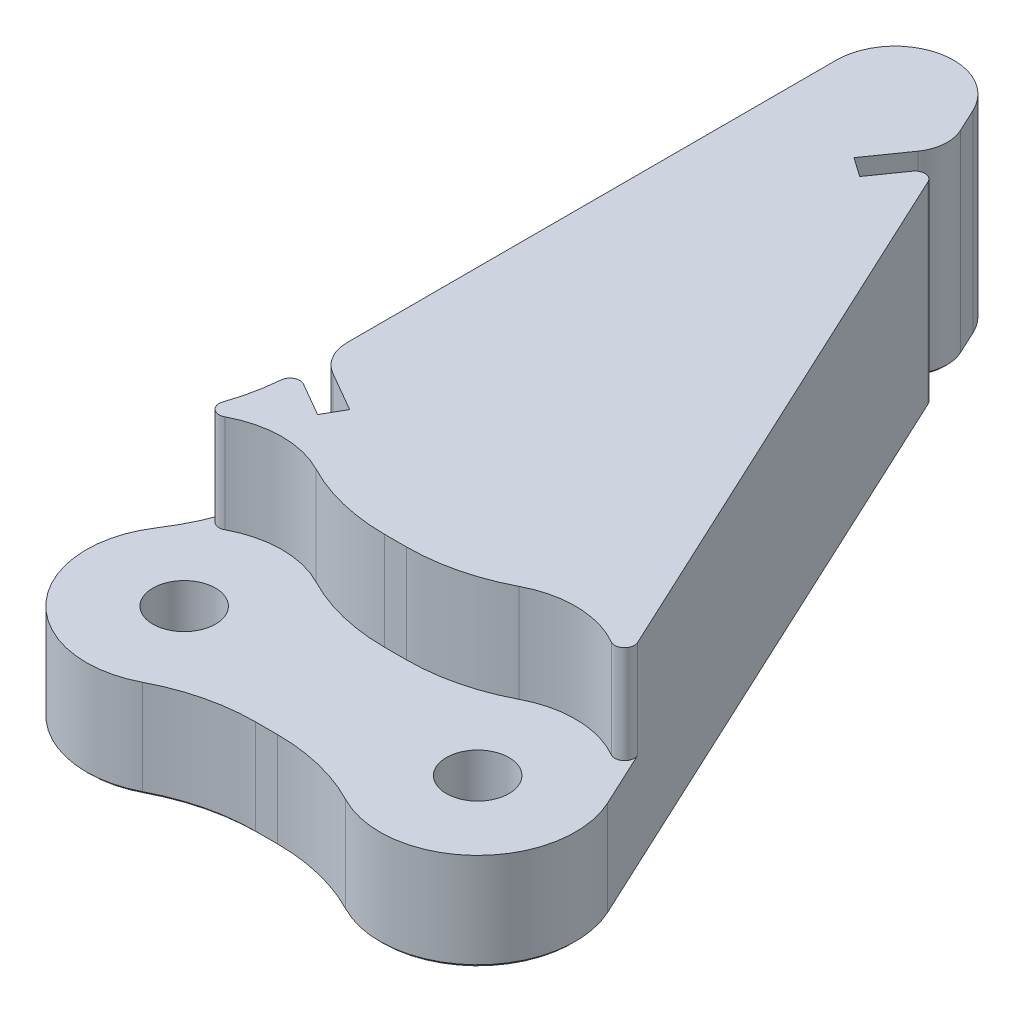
ISO-10303-21;
HEADER;
FILE_DESCRIPTION(('STEP AP214'),'2;1');
FILE_NAME('part.step','',(''),(''),'','','');
FILE_SCHEMA(('AUTOMOTIVE_DESIGN { 1 0 10303 214 1 1 1 1 }'));
ENDSEC;
DATA;
#1=APPLICATION_CONTEXT('core data for automotive mechanical design processes');
#2=APPLICATION_PROTOCOL_DEFINITION('international standard','automotive_design',2000,#1);
#3=PRODUCT_CONTEXT('',#1,'mechanical');
#4=PRODUCT('Part','Part','',(#3));
#5=PRODUCT_RELATED_PRODUCT_CATEGORY('part','',(#4));
#6=PRODUCT_DEFINITION_FORMATION('','',#4);
#7=PRODUCT_DEFINITION_CONTEXT('part definition',#1,'design');
#8=PRODUCT_DEFINITION('design','',#6,#7);
#9=PRODUCT_DEFINITION_SHAPE('','',#8);
#10=(LENGTH_UNIT() NAMED_UNIT(*) SI_UNIT(.MILLI.,.METRE.));
#11=(NAMED_UNIT(*) PLANE_ANGLE_UNIT() SI_UNIT($,.RADIAN.));
#12=(NAMED_UNIT(*) SI_UNIT($,.STERADIAN.) SOLID_ANGLE_UNIT());
#13=UNCERTAINTY_MEASURE_WITH_UNIT(LENGTH_MEASURE(1.E-05),#10,'distance_accuracy_value','');
#14=(GEOMETRIC_REPRESENTATION_CONTEXT(3) GLOBAL_UNCERTAINTY_ASSIGNED_CONTEXT((#13)) GLOBAL_UNIT_ASSIGNED_CONTEXT((#10,
#11,#12)) REPRESENTATION_CONTEXT('',''));
#15=CARTESIAN_POINT('',(0.,0.,0.));
#16=DIRECTION('',(0.,0.,1.));
#17=DIRECTION('',(1.,0.,0.));
#18=AXIS2_PLACEMENT_3D('',#15,#16,#17);
#19=CARTESIAN_POINT('',(16.8524460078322,10.,-7.85842463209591));
#20=DIRECTION('',(-0.906307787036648,0.,0.422618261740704));
#21=DIRECTION('',(0.422618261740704,0.,0.906307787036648));
#22=AXIS2_PLACEMENT_3D('',#19,#20,#21);
#23=PLANE('',#22);
#24=DIRECTION('',(0.,-1.,0.));
#25=VECTOR('',#24,1.);
#26=CARTESIAN_POINT('',(19.5315389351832,5.,-2.11309130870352));
#27=LINE('',#26,#25);
#28=CARTESIAN_POINT('',(19.5315389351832,0.160000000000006,-2.11309130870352));
#29=VERTEX_POINT('',#28);
#30=CARTESIAN_POINT('',(19.5315389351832,5.,-2.11309130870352));
#31=VERTEX_POINT('',#30);
#32=EDGE_CURVE('E405',#29,#31,#27,.F.);
#33=ORIENTED_EDGE('',*,*,#32,.F.);
#34=DIRECTION('',(-0.422618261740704,0.,-0.906307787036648));
#35=VECTOR('',#34,1.);
#36=CARTESIAN_POINT('',(16.8524460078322,0.160000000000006,-7.85842463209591));
#37=LINE('',#36,#35);
#38=CARTESIAN_POINT('',(5.22706420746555,0.160000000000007,-32.7891363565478));
#39=VERTEX_POINT('',#38);
#40=EDGE_CURVE('E73',#29,#39,#37,.T.);
#41=ORIENTED_EDGE('',*,*,#40,.T.);
#42=DIRECTION('',(0.,1.,0.));
#43=VECTOR('',#42,1.);
#44=CARTESIAN_POINT('',(5.22706420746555,10.,-32.7891363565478));
#45=LINE('',#44,#43);
#46=CARTESIAN_POINT('',(5.22706420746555,10.,-32.7891363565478));
#47=VERTEX_POINT('',#46);
#48=EDGE_CURVE('E523',#39,#47,#45,.T.);
#49=ORIENTED_EDGE('',*,*,#48,.T.);
#50=DIRECTION('',(-0.422618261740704,0.,-0.906307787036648));
#51=VECTOR('',#50,1.);
#52=CARTESIAN_POINT('',(16.8524460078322,10.,-7.85842463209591));
#53=LINE('',#52,#51);
#54=CARTESIAN_POINT('',(18.1951026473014,10.,-4.97908817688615));
#55=VERTEX_POINT('',#54);
#56=EDGE_CURVE('E427',#55,#47,#53,.T.);
#57=ORIENTED_EDGE('',*,*,#56,.F.);
#58=DIRECTION('',(0.,1.,0.));
#59=VECTOR('',#58,1.);
#60=CARTESIAN_POINT('',(18.1951026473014,5.,-4.97908817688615));
#61=LINE('',#60,#59);
#62=CARTESIAN_POINT('',(18.1951026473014,5.,-4.97908817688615));
#63=VERTEX_POINT('',#62);
#64=EDGE_CURVE('E472',#55,#63,#61,.F.);
#65=ORIENTED_EDGE('',*,*,#64,.T.);
#66=DIRECTION('',(0.422618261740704,0.,0.906307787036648));
#67=VECTOR('',#66,1.);
#68=CARTESIAN_POINT('',(16.8524460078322,5.,-7.85842463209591));
#69=LINE('',#68,#67);
#70=EDGE_CURVE('E468',#63,#31,#69,.T.);
#71=ORIENTED_EDGE('',*,*,#70,.T.);
#72=EDGE_LOOP('',(#33,#41,#49,#57,#65,#71));
#73=FACE_BOUND('',#72,.T.);
#74=ADVANCED_FACE('F47',(#73),#23,.F.);
#75=CARTESIAN_POINT('',(6.93613725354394,10.,-13.3));
#76=DIRECTION('',(0.,-1.,0.));
#77=DIRECTION('',(0.,0.,-1.));
#78=AXIS2_PLACEMENT_3D('',#75,#76,#77);
#79=CYLINDRICAL_SURFACE('',#78,10.);
#80=CARTESIAN_POINT('',(6.93613725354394,5.,-13.3));
#81=DIRECTION('',(0.,1.,0.));
#82=DIRECTION('',(0.,0.,1.));
#83=AXIS2_PLACEMENT_3D('',#80,#81,#82);
#84=CIRCLE('',#83,10.);
#85=CARTESIAN_POINT('',(6.93613725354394,5.,-3.3));
#86=VERTEX_POINT('',#85);
#87=CARTESIAN_POINT('',(2.31204575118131,5.,-4.43333333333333));
#88=VERTEX_POINT('',#87);
#89=EDGE_CURVE('E359',#86,#88,#84,.F.);
#90=ORIENTED_EDGE('',*,*,#89,.F.);
#91=DIRECTION('',(0.,-1.,0.));
#92=VECTOR('',#91,1.);
#93=CARTESIAN_POINT('',(6.93613725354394,10.,-3.3));
#94=LINE('',#93,#92);
#95=CARTESIAN_POINT('',(6.93613725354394,10.,-3.3));
#96=VERTEX_POINT('',#95);
#97=EDGE_CURVE('E464',#96,#86,#94,.T.);
#98=ORIENTED_EDGE('',*,*,#97,.F.);
#99=CARTESIAN_POINT('',(6.93613725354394,10.,-13.3));
#100=DIRECTION('',(0.,1.,0.));
#101=DIRECTION('',(0.,0.,1.));
#102=AXIS2_PLACEMENT_3D('',#99,#100,#101);
#103=CIRCLE('',#102,10.);
#104=CARTESIAN_POINT('',(2.31204575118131,10.,-4.43333333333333));
#105=VERTEX_POINT('',#104);
#106=EDGE_CURVE('E412',#96,#105,#103,.F.);
#107=ORIENTED_EDGE('',*,*,#106,.T.);
#108=DIRECTION('',(0.,-1.,0.));
#109=VECTOR('',#108,1.);
#110=CARTESIAN_POINT('',(2.31204575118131,10.,-4.43333333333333));
#111=LINE('',#110,#109);
#112=EDGE_CURVE('E444',#105,#88,#111,.T.);
#113=ORIENTED_EDGE('',*,*,#112,.T.);
#114=EDGE_LOOP('',(#90,#98,#107,#113));
#115=FACE_BOUND('',#114,.T.);
#116=ADVANCED_FACE('F846',(#115),#79,.T.);
#117=CARTESIAN_POINT('',(0.,10.,-3.3));
#118=DIRECTION('',(0.,0.,-1.));
#119=DIRECTION('',(-1.,0.,0.));
#120=AXIS2_PLACEMENT_3D('',#117,#118,#119);
#121=PLANE('',#120);
#122=ORIENTED_EDGE('',*,*,#97,.T.);
#123=DIRECTION('',(1.,0.,0.));
#124=VECTOR('',#123,1.);
#125=CARTESIAN_POINT('',(0.,5.,-3.3));
#126=LINE('',#125,#124);
#127=CARTESIAN_POINT('',(8.06386274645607,5.,-3.3));
#128=VERTEX_POINT('',#127);
#129=EDGE_CURVE('E356',#86,#128,#126,.T.);
#130=ORIENTED_EDGE('',*,*,#129,.T.);
#131=DIRECTION('',(0.,-1.,0.));
#132=VECTOR('',#131,1.);
#133=CARTESIAN_POINT('',(8.06386274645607,10.,-3.3));
#134=LINE('',#133,#132);
#135=CARTESIAN_POINT('',(8.06386274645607,10.,-3.3));
#136=VERTEX_POINT('',#135);
#137=EDGE_CURVE('E460',#136,#128,#134,.T.);
#138=ORIENTED_EDGE('',*,*,#137,.F.);
#139=DIRECTION('',(1.,0.,0.));
#140=VECTOR('',#139,1.);
#141=CARTESIAN_POINT('',(0.,10.,-3.3));
#142=LINE('',#141,#140);
#143=EDGE_CURVE('E416',#96,#136,#142,.T.);
#144=ORIENTED_EDGE('',*,*,#143,.F.);
#145=EDGE_LOOP('',(#122,#130,#138,#144));
#146=FACE_BOUND('',#145,.T.);
#147=ADVANCED_FACE('F851',(#146),#121,.F.);
#148=CARTESIAN_POINT('',(8.06386274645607,10.,-13.3));
#149=DIRECTION('',(0.,-1.,0.));
#150=DIRECTION('',(0.,0.,-1.));
#151=AXIS2_PLACEMENT_3D('',#148,#149,#150);
#152=CYLINDRICAL_SURFACE('',#151,10.);
#153=ORIENTED_EDGE('',*,*,#137,.T.);
#154=CARTESIAN_POINT('',(8.06386274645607,5.,-13.3));
#155=DIRECTION('',(0.,1.,0.));
#156=DIRECTION('',(0.,0.,1.));
#157=AXIS2_PLACEMENT_3D('',#154,#155,#156);
#158=CIRCLE('',#157,10.);
#159=CARTESIAN_POINT('',(12.6879542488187,5.,-4.43333333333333));
#160=VERTEX_POINT('',#159);
#161=EDGE_CURVE('E385',#128,#160,#158,.T.);
#162=ORIENTED_EDGE('',*,*,#161,.T.);
#163=DIRECTION('',(0.,-1.,0.));
#164=VECTOR('',#163,1.);
#165=CARTESIAN_POINT('',(12.6879542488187,10.,-4.43333333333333));
#166=LINE('',#165,#164);
#167=CARTESIAN_POINT('',(12.6879542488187,10.,-4.43333333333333));
#168=VERTEX_POINT('',#167);
#169=EDGE_CURVE('E456',#168,#160,#166,.T.);
#170=ORIENTED_EDGE('',*,*,#169,.F.);
#171=CARTESIAN_POINT('',(8.06386274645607,10.,-13.3));
#172=DIRECTION('',(0.,1.,0.));
#173=DIRECTION('',(0.,0.,1.));
#174=AXIS2_PLACEMENT_3D('',#171,#172,#173);
#175=CIRCLE('',#174,10.);
#176=EDGE_CURVE('E419',#136,#168,#175,.T.);
#177=ORIENTED_EDGE('',*,*,#176,.F.);
#178=EDGE_LOOP('',(#153,#162,#170,#177));
#179=FACE_BOUND('',#178,.T.);
#180=ADVANCED_FACE('F862',(#179),#152,.T.);
#181=CARTESIAN_POINT('',(15.,10.,0.));
#182=DIRECTION('',(0.,-1.,0.));
#183=DIRECTION('',(0.,0.,-1.));
#184=AXIS2_PLACEMENT_3D('',#181,#182,#183);
#185=CYLINDRICAL_SURFACE('',#184,5.);
#186=CARTESIAN_POINT('',(15.,5.,0.));
#187=DIRECTION('',(0.,1.,0.));
#188=DIRECTION('',(0.,0.,1.));
#189=AXIS2_PLACEMENT_3D('',#186,#187,#188);
#190=CIRCLE('',#189,5.);
#191=CARTESIAN_POINT('',(17.4926806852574,5.,-4.33434458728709));
#192=VERTEX_POINT('',#191);
#193=EDGE_CURVE('E380',#192,#160,#190,.T.);
#194=ORIENTED_EDGE('',*,*,#193,.F.);
#195=DIRECTION('',(0.,-1.,0.));
#196=VECTOR('',#195,1.);
#197=CARTESIAN_POINT('',(17.4926806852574,10.,-4.33434458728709));
#198=LINE('',#197,#196);
#199=CARTESIAN_POINT('',(17.4926806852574,10.,-4.33434458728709));
#200=VERTEX_POINT('',#199);
#201=EDGE_CURVE('E476',#192,#200,#198,.F.);
#202=ORIENTED_EDGE('',*,*,#201,.T.);
#203=CARTESIAN_POINT('',(15.,10.,0.));
#204=DIRECTION('',(0.,1.,0.));
#205=DIRECTION('',(0.,0.,1.));
#206=AXIS2_PLACEMENT_3D('',#203,#204,#205);
#207=CIRCLE('',#206,5.);
#208=EDGE_CURVE('E423',#200,#168,#207,.T.);
#209=ORIENTED_EDGE('',*,*,#208,.T.);
#210=ORIENTED_EDGE('',*,*,#169,.T.);
#211=EDGE_LOOP('',(#194,#202,#209,#210));
#212=FACE_BOUND('',#211,.T.);
#213=ADVANCED_FACE('F857',(#212),#185,.F.);
#214=DIRECTION('',(0.,1.,0.));
#215=VECTOR('',#214,1.);
#216=CARTESIAN_POINT('',(3.7874714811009,10.,-35.876352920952));
#217=LINE('',#216,#215);
#218=CARTESIAN_POINT('',(3.7874714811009,10.,-35.876352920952));
#219=VERTEX_POINT('',#218);
#220=CARTESIAN_POINT('',(3.7874714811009,0.160000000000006,-35.876352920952));
#221=VERTEX_POINT('',#220);
#222=EDGE_CURVE('E512',#219,#221,#217,.F.);
#223=ORIENTED_EDGE('',*,*,#222,.T.);
#224=DIRECTION('',(-0.422618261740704,0.,-0.906307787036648));
#225=VECTOR('',#224,1.);
#226=CARTESIAN_POINT('',(16.8524460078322,0.160000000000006,-7.85842463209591));
#227=LINE('',#226,#225);
#228=CARTESIAN_POINT('',(3.21892336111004,0.160000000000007,-37.095608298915));
#229=VERTEX_POINT('',#228);
#230=EDGE_CURVE('E628',#221,#229,#227,.T.);
#231=ORIENTED_EDGE('',*,*,#230,.T.);
#232=DIRECTION('',(0.,-1.,0.));
#233=VECTOR('',#232,1.);
#234=CARTESIAN_POINT('',(3.21892336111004,10.,-37.095608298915));
#235=LINE('',#234,#233);
#236=CARTESIAN_POINT('',(3.21892336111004,10.,-37.095608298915));
#237=VERTEX_POINT('',#236);
#238=EDGE_CURVE('E452',#237,#229,#235,.T.);
#239=ORIENTED_EDGE('',*,*,#238,.F.);
#240=EDGE_CURVE('E426',#219,#237,#53,.T.);
#241=ORIENTED_EDGE('',*,*,#240,.F.);
#242=EDGE_LOOP('',(#223,#231,#239,#241));
#243=FACE_BOUND('',#242,.T.);
#244=ADVANCED_FACE('F795',(#243),#23,.F.);
#245=CARTESIAN_POINT('',(0.499999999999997,10.,-35.8277535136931));
#246=DIRECTION('',(0.,-1.,0.));
#247=DIRECTION('',(0.,0.,-1.));
#248=AXIS2_PLACEMENT_3D('',#245,#246,#247);
#249=CYLINDRICAL_SURFACE('',#248,3.);
#250=ORIENTED_EDGE('',*,*,#238,.T.);
#251=CARTESIAN_POINT('',(0.499999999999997,0.160000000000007,-35.8277535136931));
#252=DIRECTION('',(0.,1.,0.));
#253=DIRECTION('',(0.,0.,1.));
#254=AXIS2_PLACEMENT_3D('',#251,#252,#253);
#255=CIRCLE('',#254,3.);
#256=CARTESIAN_POINT('',(-2.5,0.160000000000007,-35.8277535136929));
#257=VERTEX_POINT('',#256);
#258=EDGE_CURVE('E631',#229,#257,#255,.T.);
#259=ORIENTED_EDGE('',*,*,#258,.T.);
#260=DIRECTION('',(0.,-1.,0.));
#261=VECTOR('',#260,1.);
#262=CARTESIAN_POINT('',(-2.5,10.,-35.8277535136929));
#263=LINE('',#262,#261);
#264=CARTESIAN_POINT('',(-2.5,10.,-35.8277535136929));
#265=VERTEX_POINT('',#264);
#266=EDGE_CURVE('E448',#265,#257,#263,.T.);
#267=ORIENTED_EDGE('',*,*,#266,.F.);
#268=CARTESIAN_POINT('',(0.499999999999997,10.,-35.8277535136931));
#269=DIRECTION('',(0.,1.,0.));
#270=DIRECTION('',(0.,0.,1.));
#271=AXIS2_PLACEMENT_3D('',#268,#269,#270);
#272=CIRCLE('',#271,3.);
#273=EDGE_CURVE('E430',#237,#265,#272,.T.);
#274=ORIENTED_EDGE('',*,*,#273,.F.);
#275=EDGE_LOOP('',(#250,#259,#267,#274));
#276=FACE_BOUND('',#275,.T.);
#277=ADVANCED_FACE('F799',(#276),#249,.T.);
#278=CARTESIAN_POINT('',(-2.5,10.,0.));
#279=DIRECTION('',(1.,0.,0.));
#280=DIRECTION('',(0.,0.,-1.));
#281=AXIS2_PLACEMENT_3D('',#278,#279,#280);
#282=PLANE('',#281);
#283=ORIENTED_EDGE('',*,*,#266,.T.);
#284=DIRECTION('',(0.,0.,1.));
#285=VECTOR('',#284,1.);
#286=CARTESIAN_POINT('',(-2.5,0.160000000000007,0.));
#287=LINE('',#286,#285);
#288=CARTESIAN_POINT('',(-2.5,0.160000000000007,-10.8319031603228));
#289=VERTEX_POINT('',#288);
#290=EDGE_CURVE('E634',#257,#289,#287,.T.);
#291=ORIENTED_EDGE('',*,*,#290,.T.);
#292=DIRECTION('',(0.,1.,0.));
#293=VECTOR('',#292,1.);
#294=CARTESIAN_POINT('',(-2.5,10.,-10.8319031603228));
#295=LINE('',#294,#293);
#296=CARTESIAN_POINT('',(-2.5,10.,-10.8319031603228));
#297=VERTEX_POINT('',#296);
#298=EDGE_CURVE('E516',#289,#297,#295,.T.);
#299=ORIENTED_EDGE('',*,*,#298,.T.);
#300=DIRECTION('',(0.,0.,1.));
#301=VECTOR('',#300,1.);
#302=CARTESIAN_POINT('',(-2.5,10.,0.));
#303=LINE('',#302,#301);
#304=EDGE_CURVE('E433',#265,#297,#303,.T.);
#305=ORIENTED_EDGE('',*,*,#304,.F.);
#306=EDGE_LOOP('',(#283,#291,#299,#305));
#307=FACE_BOUND('',#306,.T.);
#308=ADVANCED_FACE('F803',(#307),#282,.F.);
#309=CARTESIAN_POINT('',(-12.5,10.,-8.2915619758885));
#310=DIRECTION('',(0.,-1.,0.));
#311=DIRECTION('',(0.,0.,-1.));
#312=AXIS2_PLACEMENT_3D('',#309,#310,#311);
#313=CYLINDRICAL_SURFACE('',#312,10.);
#314=DIRECTION('',(0.,-1.,0.));
#315=VECTOR('',#314,1.);
#316=CARTESIAN_POINT('',(-2.53253489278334,10.,-7.48555990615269));
#317=LINE('',#316,#315);
#318=CARTESIAN_POINT('',(-2.53253489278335,10.,-7.48555990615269));
#319=VERTEX_POINT('',#318);
#320=CARTESIAN_POINT('',(-2.53253489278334,0.160000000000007,-7.48555990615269));
#321=VERTEX_POINT('',#320);
#322=EDGE_CURVE('E535',#319,#321,#317,.T.);
#323=ORIENTED_EDGE('',*,*,#322,.T.);
#324=CARTESIAN_POINT('',(-12.5,0.160000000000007,-8.2915619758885));
#325=DIRECTION('',(0.,1.,0.));
#326=DIRECTION('',(0.,0.,1.));
#327=AXIS2_PLACEMENT_3D('',#324,#325,#326);
#328=CIRCLE('',#327,10.);
#329=CARTESIAN_POINT('',(-4.16666666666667,0.160000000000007,-2.76385399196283));
#330=VERTEX_POINT('',#329);
#331=EDGE_CURVE('E651',#321,#330,#328,.F.);
#332=ORIENTED_EDGE('',*,*,#331,.T.);
#333=DIRECTION('',(0.,-1.,0.));
#334=VECTOR('',#333,1.);
#335=CARTESIAN_POINT('',(-4.16666666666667,2.5,-2.76385399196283));
#336=LINE('',#335,#334);
#337=CARTESIAN_POINT('',(-4.16666666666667,5.,-2.76385399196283));
#338=VERTEX_POINT('',#337);
#339=EDGE_CURVE('E408',#338,#330,#336,.T.);
#340=ORIENTED_EDGE('',*,*,#339,.F.);
#341=CARTESIAN_POINT('',(-12.5,5.,-8.2915619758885));
#342=DIRECTION('',(0.,1.,0.));
#343=DIRECTION('',(0.,0.,1.));
#344=AXIS2_PLACEMENT_3D('',#341,#342,#343);
#345=CIRCLE('',#344,10.);
#346=CARTESIAN_POINT('',(-3.04946403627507,5.,-5.02240765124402));
#347=VERTEX_POINT('',#346);
#348=EDGE_CURVE('E493',#338,#347,#345,.T.);
#349=ORIENTED_EDGE('',*,*,#348,.T.);
#350=DIRECTION('',(0.,-1.,0.));
#351=VECTOR('',#350,1.);
#352=CARTESIAN_POINT('',(-3.04946403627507,10.,-5.02240765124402));
#353=LINE('',#352,#351);
#354=CARTESIAN_POINT('',(-3.04946403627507,10.,-5.02240765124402));
#355=VERTEX_POINT('',#354);
#356=EDGE_CURVE('E489',#347,#355,#353,.F.);
#357=ORIENTED_EDGE('',*,*,#356,.T.);
#358=CARTESIAN_POINT('',(-12.5,10.,-8.2915619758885));
#359=DIRECTION('',(0.,1.,0.));
#360=DIRECTION('',(0.,0.,1.));
#361=AXIS2_PLACEMENT_3D('',#358,#359,#360);
#362=CIRCLE('',#361,10.);
#363=EDGE_CURVE('E437',#319,#355,#362,.F.);
#364=ORIENTED_EDGE('',*,*,#363,.F.);
#365=EDGE_LOOP('',(#323,#332,#340,#349,#357,#364));
#366=FACE_BOUND('',#365,.T.);
#367=ADVANCED_FACE('F764',(#366),#313,.F.);
#368=CARTESIAN_POINT('',(0.,10.,0.));
#369=DIRECTION('',(0.,-1.,0.));
#370=DIRECTION('',(0.,0.,-1.));
#371=AXIS2_PLACEMENT_3D('',#368,#369,#370);
#372=CYLINDRICAL_SURFACE('',#371,5.);
#373=CARTESIAN_POINT('',(0.,10.,0.));
#374=DIRECTION('',(0.,1.,0.));
#375=DIRECTION('',(0.,0.,1.));
#376=AXIS2_PLACEMENT_3D('',#373,#374,#375);
#377=CIRCLE('',#376,5.);
#378=CARTESIAN_POINT('',(-2.34267021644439,10.,-4.41722721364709));
#379=VERTEX_POINT('',#378);
#380=EDGE_CURVE('E440',#105,#379,#377,.T.);
#381=ORIENTED_EDGE('',*,*,#380,.T.);
#382=DIRECTION('',(0.,-1.,0.));
#383=VECTOR('',#382,1.);
#384=CARTESIAN_POINT('',(-2.34267021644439,10.,-4.41722721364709));
#385=LINE('',#384,#383);
#386=CARTESIAN_POINT('',(-2.34267021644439,5.,-4.41722721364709));
#387=VERTEX_POINT('',#386);
#388=EDGE_CURVE('E485',#379,#387,#385,.T.);
#389=ORIENTED_EDGE('',*,*,#388,.T.);
#390=CARTESIAN_POINT('',(0.,5.,0.));
#391=DIRECTION('',(0.,1.,0.));
#392=DIRECTION('',(0.,0.,1.));
#393=AXIS2_PLACEMENT_3D('',#390,#391,#392);
#394=CIRCLE('',#393,5.);
#395=EDGE_CURVE('E364',#88,#387,#394,.T.);
#396=ORIENTED_EDGE('',*,*,#395,.F.);
#397=ORIENTED_EDGE('',*,*,#112,.F.);
#398=EDGE_LOOP('',(#381,#389,#396,#397));
#399=FACE_BOUND('',#398,.T.);
#400=ADVANCED_FACE('F773',(#399),#372,.F.);
#401=CARTESIAN_POINT('',(0.,10.,0.));
#402=DIRECTION('',(0.,1.,0.));
#403=DIRECTION('',(0.,0.,1.));
#404=AXIS2_PLACEMENT_3D('',#401,#402,#403);
#405=PLANE('',#404);
#406=ORIENTED_EDGE('',*,*,#56,.T.);
#407=CARTESIAN_POINT('',(4.77391031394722,10.,-32.5778272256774));
#408=DIRECTION('',(0.,1.,0.));
#409=DIRECTION('',(0.,0.,1.));
#410=AXIS2_PLACEMENT_3D('',#407,#408,#409);
#411=CIRCLE('',#410,0.5);
#412=CARTESIAN_POINT('',(4.36433429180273,10.,-32.864615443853));
#413=VERTEX_POINT('',#412);
#414=EDGE_CURVE('E529',#47,#413,#411,.T.);
#415=ORIENTED_EDGE('',*,*,#414,.T.);
#416=DIRECTION('',(0.573576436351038,0.,-0.819152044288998));
#417=VECTOR('',#416,1.);
#418=CARTESIAN_POINT('',(3.25093394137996,10.,-31.2745149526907));
#419=LINE('',#418,#417);
#420=CARTESIAN_POINT('',(3.25093394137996,10.,-31.2745149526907));
#421=VERTEX_POINT('',#420);
#422=EDGE_CURVE('E335',#421,#413,#419,.T.);
#423=ORIENTED_EDGE('',*,*,#422,.F.);
#424=DIRECTION('',(0.819152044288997,0.,0.573576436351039));
#425=VECTOR('',#424,1.);
#426=CARTESIAN_POINT('',(2.26795148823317,10.,-31.9628066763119));
#427=LINE('',#426,#425);
#428=CARTESIAN_POINT('',(2.26795148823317,10.,-31.9628066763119));
#429=VERTEX_POINT('',#428);
#430=EDGE_CURVE('E342',#429,#421,#427,.T.);
#431=ORIENTED_EDGE('',*,*,#430,.F.);
#432=DIRECTION('',(-0.573576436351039,0.,0.819152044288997));
#433=VECTOR('',#432,1.);
#434=CARTESIAN_POINT('',(4.2754690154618,10.,-34.8298388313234));
#435=LINE('',#434,#433);
#436=CARTESIAN_POINT('',(3.61315999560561,10.,-33.8839635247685));
#437=VERTEX_POINT('',#436);
#438=EDGE_CURVE('E319',#437,#429,#435,.T.);
#439=ORIENTED_EDGE('',*,*,#438,.F.);
#440=CARTESIAN_POINT('',(1.97485590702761,10.,-35.0311163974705));
#441=DIRECTION('',(0.,1.,0.));
#442=DIRECTION('',(0.,0.,1.));
#443=AXIS2_PLACEMENT_3D('',#440,#441,#442);
#444=CIRCLE('',#443,2.);
#445=EDGE_CURVE('E509',#437,#219,#444,.T.);
#446=ORIENTED_EDGE('',*,*,#445,.T.);
#447=ORIENTED_EDGE('',*,*,#240,.T.);
#448=ORIENTED_EDGE('',*,*,#273,.T.);
#449=ORIENTED_EDGE('',*,*,#304,.T.);
#450=CARTESIAN_POINT('',(-0.500000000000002,10.,-10.8319031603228));
#451=DIRECTION('',(0.,1.,0.));
#452=DIRECTION('',(0.,0.,1.));
#453=AXIS2_PLACEMENT_3D('',#450,#451,#452);
#454=CIRCLE('',#453,2.);
#455=CARTESIAN_POINT('',(-1.50000000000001,10.,-9.09985235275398));
#456=VERTEX_POINT('',#455);
#457=EDGE_CURVE('E506',#297,#456,#454,.T.);
#458=ORIENTED_EDGE('',*,*,#457,.T.);
#459=DIRECTION('',(-0.866025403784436,0.,-0.500000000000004));
#460=VECTOR('',#459,1.);
#461=CARTESIAN_POINT('',(0.531088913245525,10.,-7.92720262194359));
#462=LINE('',#461,#460);
#463=CARTESIAN_POINT('',(0.531088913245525,10.,-7.92720262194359));
#464=VERTEX_POINT('',#463);
#465=EDGE_CURVE('E309',#464,#456,#462,.T.);
#466=ORIENTED_EDGE('',*,*,#465,.F.);
#467=DIRECTION('',(0.500000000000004,0.,-0.866025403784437));
#468=VECTOR('',#467,1.);
#469=CARTESIAN_POINT('',(-0.0689110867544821,10.,-6.88797213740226));
#470=LINE('',#469,#468);
#471=CARTESIAN_POINT('',(-0.0689110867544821,10.,-6.88797213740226));
#472=VERTEX_POINT('',#471);
#473=EDGE_CURVE('E301',#472,#464,#470,.T.);
#474=ORIENTED_EDGE('',*,*,#473,.F.);
#475=DIRECTION('',(0.866025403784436,0.,0.500000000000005));
#476=VECTOR('',#475,1.);
#477=CARTESIAN_POINT('',(-2.5,10.,-8.2915619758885));
#478=LINE('',#477,#476);
#479=CARTESIAN_POINT('',(-1.78416163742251,10.,-7.87827250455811));
#480=VERTEX_POINT('',#479);
#481=EDGE_CURVE('E312',#480,#472,#478,.T.);
#482=ORIENTED_EDGE('',*,*,#481,.F.);
#483=CARTESIAN_POINT('',(-2.03416163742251,10.,-7.4452598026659));
#484=DIRECTION('',(0.,1.,0.));
#485=DIRECTION('',(0.,0.,1.));
#486=AXIS2_PLACEMENT_3D('',#483,#484,#485);
#487=CIRCLE('',#486,0.5);
#488=EDGE_CURVE('E526',#480,#319,#487,.T.);
#489=ORIENTED_EDGE('',*,*,#488,.T.);
#490=ORIENTED_EDGE('',*,*,#363,.T.);
#491=CARTESIAN_POINT('',(-2.57693723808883,10.,-4.8589499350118));
#492=DIRECTION('',(0.,1.,0.));
#493=DIRECTION('',(0.,0.,1.));
#494=AXIS2_PLACEMENT_3D('',#491,#492,#493);
#495=CIRCLE('',#494,0.5);
#496=EDGE_CURVE('E479',#355,#379,#495,.T.);
#497=ORIENTED_EDGE('',*,*,#496,.T.);
#498=ORIENTED_EDGE('',*,*,#380,.F.);
#499=ORIENTED_EDGE('',*,*,#106,.F.);
#500=ORIENTED_EDGE('',*,*,#143,.T.);
#501=ORIENTED_EDGE('',*,*,#176,.T.);
#502=ORIENTED_EDGE('',*,*,#208,.F.);
#503=CARTESIAN_POINT('',(17.7419487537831,10.,-4.7677790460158));
#504=DIRECTION('',(0.,1.,0.));
#505=DIRECTION('',(0.,0.,1.));
#506=AXIS2_PLACEMENT_3D('',#503,#504,#505);
#507=CIRCLE('',#506,0.5);
#508=EDGE_CURVE('E482',#200,#55,#507,.T.);
#509=ORIENTED_EDGE('',*,*,#508,.T.);
#510=EDGE_LOOP('',(#406,#415,#423,#431,#439,#446,#447,#448,#449,#458,#466,#474,#482,#489,#490,
#497,#498,#499,#500,#501,#502,#509));
#511=FACE_BOUND('',#510,.T.);
#512=ADVANCED_FACE('F322',(#511),#405,.T.);
#513=CARTESIAN_POINT('',(0.,0.,0.));
#514=DIRECTION('',(0.,1.,0.));
#515=DIRECTION('',(0.,0.,1.));
#516=AXIS2_PLACEMENT_3D('',#513,#514,#515);
#517=PLANE('',#516);
#518=CARTESIAN_POINT('',(15.,0.,0.));
#519=DIRECTION('',(0.,1.,0.));
#520=DIRECTION('',(0.,0.,1.));
#521=AXIS2_PLACEMENT_3D('',#518,#519,#520);
#522=CIRCLE('',#521,1.75999999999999);
#523=CARTESIAN_POINT('',(15.,0.,1.75999999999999));
#524=VERTEX_POINT('',#523);
#525=EDGE_CURVE('E606',#524,#524,#522,.T.);
#526=ORIENTED_EDGE('',*,*,#525,.T.);
#527=EDGE_LOOP('',(#526));
#528=FACE_BOUND('',#527,.T.);
#529=CARTESIAN_POINT('',(0.,0.,0.));
#530=DIRECTION('',(0.,1.,0.));
#531=DIRECTION('',(0.,0.,1.));
#532=AXIS2_PLACEMENT_3D('',#529,#530,#531);
#533=CIRCLE('',#532,1.75999999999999);
#534=CARTESIAN_POINT('',(0.,0.,1.75999999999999));
#535=VERTEX_POINT('',#534);
#536=EDGE_CURVE('E602',#535,#535,#533,.T.);
#537=ORIENTED_EDGE('',*,*,#536,.T.);
#538=EDGE_LOOP('',(#537));
#539=FACE_BOUND('',#538,.T.);
#540=DIRECTION('',(-0.573576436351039,0.,0.819152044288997));
#541=VECTOR('',#540,1.);
#542=CARTESIAN_POINT('',(-13.6268528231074,0.,-9.54162506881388));
#543=LINE('',#542,#541);
#544=CARTESIAN_POINT('',(3.48209566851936,0.,-33.9757357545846));
#545=VERTEX_POINT('',#544);
#546=CARTESIAN_POINT('',(2.04511493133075,0.,-31.9235145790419));
#547=VERTEX_POINT('',#546);
#548=EDGE_CURVE('E595',#545,#547,#543,.T.);
#549=ORIENTED_EDGE('',*,*,#548,.T.);
#550=DIRECTION('',(0.819152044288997,0.,0.573576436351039));
#551=VECTOR('',#550,1.);
#552=CARTESIAN_POINT('',(15.6719677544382,0.,-22.381889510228));
#553=LINE('',#552,#551);
#554=CARTESIAN_POINT('',(3.29022603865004,0.,-31.0516783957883));
#555=VERTEX_POINT('',#554);
#556=EDGE_CURVE('E598',#547,#555,#553,.T.);
#557=ORIENTED_EDGE('',*,*,#556,.T.);
#558=DIRECTION('',(0.573576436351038,0.,-0.819152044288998));
#559=VECTOR('',#558,1.);
#560=CARTESIAN_POINT('',(-12.3817417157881,0.,-8.66978888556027));
#561=LINE('',#560,#559);
#562=CARTESIAN_POINT('',(4.49539861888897,0.,-32.7728432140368));
#563=VERTEX_POINT('',#562);
#564=EDGE_CURVE('E541',#555,#563,#561,.T.);
#565=ORIENTED_EDGE('',*,*,#564,.T.);
#566=CARTESIAN_POINT('',(4.77391031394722,0.,-32.5778272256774));
#567=DIRECTION('',(0.,1.,0.));
#568=DIRECTION('',(0.,0.,1.));
#569=AXIS2_PLACEMENT_3D('',#566,#567,#568);
#570=CIRCLE('',#569,0.339999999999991);
#571=CARTESIAN_POINT('',(5.08205496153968,0.,-32.7215174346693));
#572=VERTEX_POINT('',#571);
#573=EDGE_CURVE('E544',#563,#572,#570,.F.);
#574=ORIENTED_EDGE('',*,*,#573,.T.);
#575=DIRECTION('',(0.422618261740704,0.,0.906307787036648));
#576=VECTOR('',#575,1.);
#577=CARTESIAN_POINT('',(16.7074367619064,0.,-7.79080571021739));
#578=LINE('',#577,#576);
#579=CARTESIAN_POINT('',(19.3865296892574,0.,-2.04547238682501));
#580=VERTEX_POINT('',#579);
#581=EDGE_CURVE('E547',#572,#580,#578,.T.);
#582=ORIENTED_EDGE('',*,*,#581,.T.);
#583=CARTESIAN_POINT('',(15.,0.,0.));
#584=DIRECTION('',(0.,1.,0.));
#585=DIRECTION('',(0.,0.,1.));
#586=AXIS2_PLACEMENT_3D('',#583,#584,#585);
#587=CIRCLE('',#586,4.83999999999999);
#588=CARTESIAN_POINT('',(12.7619397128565,0.,4.29146666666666));
#589=VERTEX_POINT('',#588);
#590=EDGE_CURVE('E550',#580,#589,#587,.F.);
#591=ORIENTED_EDGE('',*,*,#590,.T.);
#592=CARTESIAN_POINT('',(8.06386274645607,0.,13.3));
#593=DIRECTION('',(0.,1.,0.));
#594=DIRECTION('',(0.,0.,1.));
#595=AXIS2_PLACEMENT_3D('',#592,#593,#594);
#596=CIRCLE('',#595,10.16);
#597=CARTESIAN_POINT('',(8.06386274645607,0.,3.13999999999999));
#598=VERTEX_POINT('',#597);
#599=EDGE_CURVE('E553',#589,#598,#596,.T.);
#600=ORIENTED_EDGE('',*,*,#599,.T.);
#601=DIRECTION('',(-1.,0.,0.));
#602=VECTOR('',#601,1.);
#603=CARTESIAN_POINT('',(0.,0.,3.13999999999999));
#604=LINE('',#603,#602);
#605=CARTESIAN_POINT('',(6.93613725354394,0.,3.13999999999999));
#606=VERTEX_POINT('',#605);
#607=EDGE_CURVE('E556',#598,#606,#604,.T.);
#608=ORIENTED_EDGE('',*,*,#607,.T.);
#609=CARTESIAN_POINT('',(6.93613725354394,0.,13.3));
#610=DIRECTION('',(0.,1.,0.));
#611=DIRECTION('',(0.,0.,1.));
#612=AXIS2_PLACEMENT_3D('',#609,#610,#611);
#613=CIRCLE('',#612,10.16);
#614=CARTESIAN_POINT('',(2.23806028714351,0.,4.29146666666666));
#615=VERTEX_POINT('',#614);
#616=EDGE_CURVE('E559',#606,#615,#613,.T.);
#617=ORIENTED_EDGE('',*,*,#616,.T.);
#618=CARTESIAN_POINT('',(0.,0.,0.));
#619=DIRECTION('',(0.,1.,0.));
#620=DIRECTION('',(0.,0.,1.));
#621=AXIS2_PLACEMENT_3D('',#618,#619,#620);
#622=CIRCLE('',#621,4.83999999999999);
#623=CARTESIAN_POINT('',(-4.03333333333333,0.,-2.67541066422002));
#624=VERTEX_POINT('',#623);
#625=EDGE_CURVE('E562',#615,#624,#622,.F.);
#626=ORIENTED_EDGE('',*,*,#625,.T.);
#627=CARTESIAN_POINT('',(-12.5,0.,-8.2915619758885));
#628=DIRECTION('',(0.,1.,0.));
#629=DIRECTION('',(0.,0.,1.));
#630=AXIS2_PLACEMENT_3D('',#627,#628,#629);
#631=CIRCLE('',#630,10.16);
#632=CARTESIAN_POINT('',(-2.37305545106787,0.,-7.47266387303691));
#633=VERTEX_POINT('',#632);
#634=EDGE_CURVE('E565',#624,#633,#631,.T.);
#635=ORIENTED_EDGE('',*,*,#634,.T.);
#636=CARTESIAN_POINT('',(-2.03416163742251,0.,-7.4452598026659));
#637=DIRECTION('',(0.,1.,0.));
#638=DIRECTION('',(0.,0.,1.));
#639=AXIS2_PLACEMENT_3D('',#636,#637,#638);
#640=CIRCLE('',#639,0.339999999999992);
#641=CARTESIAN_POINT('',(-1.86416163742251,0.,-7.7397084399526));
#642=VERTEX_POINT('',#641);
#643=EDGE_CURVE('E568',#633,#642,#640,.F.);
#644=ORIENTED_EDGE('',*,*,#643,.T.);
#645=DIRECTION('',(0.866025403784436,0.,0.500000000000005));
#646=VECTOR('',#645,1.);
#647=CARTESIAN_POINT('',(2.88535165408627,0.,-4.99757566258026));
#648=LINE('',#647,#646);
#649=CARTESIAN_POINT('',(-0.0103470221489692,0.,-6.66940807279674));
#650=VERTEX_POINT('',#649);
#651=EDGE_CURVE('E571',#642,#650,#648,.T.);
#652=ORIENTED_EDGE('',*,*,#651,.T.);
#653=DIRECTION('',(0.500000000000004,0.,-0.866025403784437));
#654=VECTOR('',#653,1.);
#655=CARTESIAN_POINT('',(-2.89569867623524,0.,-1.67183241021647));
#656=LINE('',#655,#654);
#657=CARTESIAN_POINT('',(0.749652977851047,0.,-7.98576668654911));
#658=VERTEX_POINT('',#657);
#659=EDGE_CURVE('E574',#650,#658,#656,.T.);
#660=ORIENTED_EDGE('',*,*,#659,.T.);
#661=DIRECTION('',(-0.866025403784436,0.,-0.500000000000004));
#662=VECTOR('',#661,1.);
#663=CARTESIAN_POINT('',(3.64535165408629,0.,-6.31393427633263));
#664=LINE('',#663,#662);
#665=CARTESIAN_POINT('',(-1.42,0.,-9.2384164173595));
#666=VERTEX_POINT('',#665);
#667=EDGE_CURVE('E577',#658,#666,#664,.T.);
#668=ORIENTED_EDGE('',*,*,#667,.T.);
#669=CARTESIAN_POINT('',(-0.500000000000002,0.,-10.8319031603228));
#670=DIRECTION('',(0.,1.,0.));
#671=DIRECTION('',(0.,0.,1.));
#672=AXIS2_PLACEMENT_3D('',#669,#670,#671);
#673=CIRCLE('',#672,1.83999999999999);
#674=CARTESIAN_POINT('',(-2.33999999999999,0.,-10.8319031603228));
#675=VERTEX_POINT('',#674);
#676=EDGE_CURVE('E580',#666,#675,#673,.F.);
#677=ORIENTED_EDGE('',*,*,#676,.T.);
#678=DIRECTION('',(0.,0.,-1.));
#679=VECTOR('',#678,1.);
#680=CARTESIAN_POINT('',(-2.33999999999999,0.,0.));
#681=LINE('',#680,#679);
#682=CARTESIAN_POINT('',(-2.34,0.,-35.8277535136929));
#683=VERTEX_POINT('',#682);
#684=EDGE_CURVE('E583',#675,#683,#681,.T.);
#685=ORIENTED_EDGE('',*,*,#684,.T.);
#686=CARTESIAN_POINT('',(0.499999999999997,0.,-35.8277535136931));
#687=DIRECTION('',(0.,1.,0.));
#688=DIRECTION('',(0.,0.,1.));
#689=AXIS2_PLACEMENT_3D('',#686,#687,#688);
#690=CIRCLE('',#689,2.83999999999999);
#691=CARTESIAN_POINT('',(3.07391411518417,0.,-37.0279893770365));
#692=VERTEX_POINT('',#691);
#693=EDGE_CURVE('E586',#683,#692,#690,.F.);
#694=ORIENTED_EDGE('',*,*,#693,.T.);
#695=DIRECTION('',(0.422618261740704,0.,0.906307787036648));
#696=VECTOR('',#695,1.);
#697=CARTESIAN_POINT('',(16.7074367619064,0.,-7.79080571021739));
#698=LINE('',#697,#696);
#699=CARTESIAN_POINT('',(3.64246223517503,0.,-35.8087339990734));
#700=VERTEX_POINT('',#699);
#701=EDGE_CURVE('E589',#692,#700,#698,.T.);
#702=ORIENTED_EDGE('',*,*,#701,.T.);
#703=CARTESIAN_POINT('',(1.97485590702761,0.,-35.0311163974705));
#704=DIRECTION('',(0.,1.,0.));
#705=DIRECTION('',(0.,0.,1.));
#706=AXIS2_PLACEMENT_3D('',#703,#704,#705);
#707=CIRCLE('',#706,1.83999999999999);
#708=EDGE_CURVE('E592',#700,#545,#707,.F.);
#709=ORIENTED_EDGE('',*,*,#708,.T.);
#710=EDGE_LOOP('',(#549,#557,#565,#574,#582,#591,#600,#608,#617,#626,#635,#644,#652,#660,#668,
#677,#685,#694,#702,#709));
#711=FACE_BOUND('',#710,.T.);
#712=ADVANCED_FACE('F824',(#528,#539,#711),#517,.F.);
#713=CARTESIAN_POINT('',(0.,5.,0.));
#714=DIRECTION('',(0.,-1.,0.));
#715=DIRECTION('',(0.,0.,-1.));
#716=AXIS2_PLACEMENT_3D('',#713,#714,#715);
#717=CYLINDRICAL_SURFACE('',#716,5.);
#718=ORIENTED_EDGE('',*,*,#339,.T.);
#719=CARTESIAN_POINT('',(0.,0.160000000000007,0.));
#720=DIRECTION('',(0.,1.,0.));
#721=DIRECTION('',(0.,0.,1.));
#722=AXIS2_PLACEMENT_3D('',#719,#720,#721);
#723=CIRCLE('',#722,5.);
#724=CARTESIAN_POINT('',(2.31204575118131,0.160000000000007,4.43333333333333));
#725=VERTEX_POINT('',#724);
#726=EDGE_CURVE('E654',#330,#725,#723,.T.);
#727=ORIENTED_EDGE('',*,*,#726,.T.);
#728=DIRECTION('',(0.,-1.,0.));
#729=VECTOR('',#728,1.);
#730=CARTESIAN_POINT('',(2.31204575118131,5.,4.43333333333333));
#731=LINE('',#730,#729);
#732=CARTESIAN_POINT('',(2.31204575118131,5.,4.43333333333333));
#733=VERTEX_POINT('',#732);
#734=EDGE_CURVE('E401',#733,#725,#731,.T.);
#735=ORIENTED_EDGE('',*,*,#734,.F.);
#736=EDGE_CURVE('E363',#338,#733,#394,.T.);
#737=ORIENTED_EDGE('',*,*,#736,.F.);
#738=EDGE_LOOP('',(#718,#727,#735,#737));
#739=FACE_BOUND('',#738,.T.);
#740=ADVANCED_FACE('F782',(#739),#717,.T.);
#741=CARTESIAN_POINT('',(15.,5.,0.));
#742=DIRECTION('',(0.,-1.,0.));
#743=DIRECTION('',(0.,0.,-1.));
#744=AXIS2_PLACEMENT_3D('',#741,#742,#743);
#745=CYLINDRICAL_SURFACE('',#744,5.);
#746=DIRECTION('',(0.,-1.,0.));
#747=VECTOR('',#746,1.);
#748=CARTESIAN_POINT('',(12.6879542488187,5.,4.43333333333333));
#749=LINE('',#748,#747);
#750=CARTESIAN_POINT('',(12.6879542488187,5.,4.43333333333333));
#751=VERTEX_POINT('',#750);
#752=CARTESIAN_POINT('',(12.6879542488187,0.160000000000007,4.43333333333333));
#753=VERTEX_POINT('',#752);
#754=EDGE_CURVE('E389',#751,#753,#749,.T.);
#755=ORIENTED_EDGE('',*,*,#754,.T.);
#756=CARTESIAN_POINT('',(15.,0.160000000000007,0.));
#757=DIRECTION('',(0.,1.,0.));
#758=DIRECTION('',(0.,0.,1.));
#759=AXIS2_PLACEMENT_3D('',#756,#757,#758);
#760=CIRCLE('',#759,5.);
#761=EDGE_CURVE('E666',#753,#29,#760,.T.);
#762=ORIENTED_EDGE('',*,*,#761,.T.);
#763=ORIENTED_EDGE('',*,*,#32,.T.);
#764=EDGE_CURVE('E381',#751,#31,#190,.T.);
#765=ORIENTED_EDGE('',*,*,#764,.F.);
#766=EDGE_LOOP('',(#755,#762,#763,#765));
#767=FACE_BOUND('',#766,.T.);
#768=ADVANCED_FACE('F1144',(#767),#745,.T.);
#769=CARTESIAN_POINT('',(6.93613725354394,5.,13.3));
#770=DIRECTION('',(0.,-1.,0.));
#771=DIRECTION('',(0.,0.,-1.));
#772=AXIS2_PLACEMENT_3D('',#769,#770,#771);
#773=CYLINDRICAL_SURFACE('',#772,10.);
#774=ORIENTED_EDGE('',*,*,#734,.T.);
#775=CARTESIAN_POINT('',(6.93613725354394,0.160000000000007,13.3));
#776=DIRECTION('',(0.,1.,0.));
#777=DIRECTION('',(0.,0.,1.));
#778=AXIS2_PLACEMENT_3D('',#775,#776,#777);
#779=CIRCLE('',#778,10.);
#780=CARTESIAN_POINT('',(6.93613725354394,0.160000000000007,3.3));
#781=VERTEX_POINT('',#780);
#782=EDGE_CURVE('E657',#725,#781,#779,.F.);
#783=ORIENTED_EDGE('',*,*,#782,.T.);
#784=DIRECTION('',(0.,-1.,0.));
#785=VECTOR('',#784,1.);
#786=CARTESIAN_POINT('',(6.93613725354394,5.,3.3));
#787=LINE('',#786,#785);
#788=CARTESIAN_POINT('',(6.93613725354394,5.,3.3));
#789=VERTEX_POINT('',#788);
#790=EDGE_CURVE('E397',#789,#781,#787,.T.);
#791=ORIENTED_EDGE('',*,*,#790,.F.);
#792=CARTESIAN_POINT('',(6.93613725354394,5.,13.3));
#793=DIRECTION('',(0.,1.,0.));
#794=DIRECTION('',(0.,0.,1.));
#795=AXIS2_PLACEMENT_3D('',#792,#793,#794);
#796=CIRCLE('',#795,10.);
#797=EDGE_CURVE('E368',#789,#733,#796,.T.);
#798=ORIENTED_EDGE('',*,*,#797,.T.);
#799=EDGE_LOOP('',(#774,#783,#791,#798));
#800=FACE_BOUND('',#799,.T.);
#801=ADVANCED_FACE('F1136',(#800),#773,.F.);
#802=CARTESIAN_POINT('',(0.,5.,3.3));
#803=DIRECTION('',(0.,0.,-1.));
#804=DIRECTION('',(-1.,0.,0.));
#805=AXIS2_PLACEMENT_3D('',#802,#803,#804);
#806=PLANE('',#805);
#807=ORIENTED_EDGE('',*,*,#790,.T.);
#808=DIRECTION('',(1.,0.,0.));
#809=VECTOR('',#808,1.);
#810=CARTESIAN_POINT('',(0.,0.160000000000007,3.3));
#811=LINE('',#810,#809);
#812=CARTESIAN_POINT('',(8.06386274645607,0.160000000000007,3.3));
#813=VERTEX_POINT('',#812);
#814=EDGE_CURVE('E660',#781,#813,#811,.T.);
#815=ORIENTED_EDGE('',*,*,#814,.T.);
#816=DIRECTION('',(0.,-1.,0.));
#817=VECTOR('',#816,1.);
#818=CARTESIAN_POINT('',(8.06386274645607,5.,3.3));
#819=LINE('',#818,#817);
#820=CARTESIAN_POINT('',(8.06386274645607,5.,3.3));
#821=VERTEX_POINT('',#820);
#822=EDGE_CURVE('E393',#821,#813,#819,.T.);
#823=ORIENTED_EDGE('',*,*,#822,.F.);
#824=DIRECTION('',(1.,0.,0.));
#825=VECTOR('',#824,1.);
#826=CARTESIAN_POINT('',(0.,5.,3.3));
#827=LINE('',#826,#825);
#828=EDGE_CURVE('E372',#789,#821,#827,.T.);
#829=ORIENTED_EDGE('',*,*,#828,.F.);
#830=EDGE_LOOP('',(#807,#815,#823,#829));
#831=FACE_BOUND('',#830,.T.);
#832=ADVANCED_FACE('F1128',(#831),#806,.F.);
#833=CARTESIAN_POINT('',(8.06386274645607,5.,13.3));
#834=DIRECTION('',(0.,-1.,0.));
#835=DIRECTION('',(0.,0.,-1.));
#836=AXIS2_PLACEMENT_3D('',#833,#834,#835);
#837=CYLINDRICAL_SURFACE('',#836,10.);
#838=ORIENTED_EDGE('',*,*,#822,.T.);
#839=CARTESIAN_POINT('',(8.06386274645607,0.160000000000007,13.3));
#840=DIRECTION('',(0.,1.,0.));
#841=DIRECTION('',(0.,0.,1.));
#842=AXIS2_PLACEMENT_3D('',#839,#840,#841);
#843=CIRCLE('',#842,10.);
#844=EDGE_CURVE('E663',#813,#753,#843,.F.);
#845=ORIENTED_EDGE('',*,*,#844,.T.);
#846=ORIENTED_EDGE('',*,*,#754,.F.);
#847=CARTESIAN_POINT('',(8.06386274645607,5.,13.3));
#848=DIRECTION('',(0.,1.,0.));
#849=DIRECTION('',(0.,0.,1.));
#850=AXIS2_PLACEMENT_3D('',#847,#848,#849);
#851=CIRCLE('',#850,10.);
#852=EDGE_CURVE('E376',#821,#751,#851,.F.);
#853=ORIENTED_EDGE('',*,*,#852,.F.);
#854=EDGE_LOOP('',(#838,#845,#846,#853));
#855=FACE_BOUND('',#854,.T.);
#856=ADVANCED_FACE('F1120',(#855),#837,.F.);
#857=CARTESIAN_POINT('',(15.,5.,0.));
#858=DIRECTION('',(0.,-1.,0.));
#859=DIRECTION('',(0.,0.,-1.));
#860=AXIS2_PLACEMENT_3D('',#857,#858,#859);
#861=CYLINDRICAL_SURFACE('',#860,1.6);
#862=CARTESIAN_POINT('',(15.,0.159999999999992,0.));
#863=DIRECTION('',(0.,1.,0.));
#864=DIRECTION('',(0.,0.,1.));
#865=AXIS2_PLACEMENT_3D('',#862,#863,#864);
#866=CIRCLE('',#865,1.6);
#867=CARTESIAN_POINT('',(15.,0.159999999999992,1.6));
#868=VERTEX_POINT('',#867);
#869=EDGE_CURVE('E610',#868,#868,#866,.F.);
#870=ORIENTED_EDGE('',*,*,#869,.T.);
#871=EDGE_LOOP('',(#870));
#872=FACE_BOUND('',#871,.T.);
#873=CARTESIAN_POINT('',(15.,5.,0.));
#874=DIRECTION('',(0.,1.,0.));
#875=DIRECTION('',(0.,0.,1.));
#876=AXIS2_PLACEMENT_3D('',#873,#874,#875);
#877=CIRCLE('',#876,1.6);
#878=CARTESIAN_POINT('',(15.,5.,1.6));
#879=VERTEX_POINT('',#878);
#880=EDGE_CURVE('E352',#879,#879,#877,.T.);
#881=ORIENTED_EDGE('',*,*,#880,.T.);
#882=EDGE_LOOP('',(#881));
#883=FACE_BOUND('',#882,.T.);
#884=ADVANCED_FACE('F1112',(#872,#883),#861,.F.);
#885=CARTESIAN_POINT('',(0.,5.,0.));
#886=DIRECTION('',(0.,-1.,0.));
#887=DIRECTION('',(0.,0.,-1.));
#888=AXIS2_PLACEMENT_3D('',#885,#886,#887);
#889=CYLINDRICAL_SURFACE('',#888,1.6);
#890=CARTESIAN_POINT('',(0.,0.159999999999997,0.));
#891=DIRECTION('',(0.,1.,0.));
#892=DIRECTION('',(0.,0.,1.));
#893=AXIS2_PLACEMENT_3D('',#890,#891,#892);
#894=CIRCLE('',#893,1.6);
#895=CARTESIAN_POINT('',(0.,0.159999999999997,1.6));
#896=VERTEX_POINT('',#895);
#897=EDGE_CURVE('E614',#896,#896,#894,.F.);
#898=ORIENTED_EDGE('',*,*,#897,.T.);
#899=EDGE_LOOP('',(#898));
#900=FACE_BOUND('',#899,.T.);
#901=CARTESIAN_POINT('',(0.,5.,0.));
#902=DIRECTION('',(0.,1.,0.));
#903=DIRECTION('',(0.,0.,1.));
#904=AXIS2_PLACEMENT_3D('',#901,#902,#903);
#905=CIRCLE('',#904,1.6);
#906=CARTESIAN_POINT('',(0.,5.,1.6));
#907=VERTEX_POINT('',#906);
#908=EDGE_CURVE('E330',#907,#907,#905,.T.);
#909=ORIENTED_EDGE('',*,*,#908,.T.);
#910=EDGE_LOOP('',(#909));
#911=FACE_BOUND('',#910,.T.);
#912=ADVANCED_FACE('F1104',(#900,#911),#889,.F.);
#913=CARTESIAN_POINT('',(0.,5.,0.));
#914=DIRECTION('',(0.,1.,0.));
#915=DIRECTION('',(0.,0.,1.));
#916=AXIS2_PLACEMENT_3D('',#913,#914,#915);
#917=PLANE('',#916);
#918=ORIENTED_EDGE('',*,*,#908,.F.);
#919=EDGE_LOOP('',(#918));
#920=FACE_BOUND('',#919,.T.);
#921=ORIENTED_EDGE('',*,*,#880,.F.);
#922=EDGE_LOOP('',(#921));
#923=FACE_BOUND('',#922,.T.);
#924=ORIENTED_EDGE('',*,*,#129,.F.);
#925=ORIENTED_EDGE('',*,*,#89,.T.);
#926=ORIENTED_EDGE('',*,*,#395,.T.);
#927=CARTESIAN_POINT('',(-2.57693723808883,5.,-4.8589499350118));
#928=DIRECTION('',(0.,1.,0.));
#929=DIRECTION('',(0.,0.,1.));
#930=AXIS2_PLACEMENT_3D('',#927,#928,#929);
#931=CIRCLE('',#930,0.5);
#932=EDGE_CURVE('E500',#387,#347,#931,.F.);
#933=ORIENTED_EDGE('',*,*,#932,.T.);
#934=ORIENTED_EDGE('',*,*,#348,.F.);
#935=ORIENTED_EDGE('',*,*,#736,.T.);
#936=ORIENTED_EDGE('',*,*,#797,.F.);
#937=ORIENTED_EDGE('',*,*,#828,.T.);
#938=ORIENTED_EDGE('',*,*,#852,.T.);
#939=ORIENTED_EDGE('',*,*,#764,.T.);
#940=ORIENTED_EDGE('',*,*,#70,.F.);
#941=CARTESIAN_POINT('',(17.7419487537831,5.,-4.7677790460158));
#942=DIRECTION('',(0.,1.,0.));
#943=DIRECTION('',(0.,0.,1.));
#944=AXIS2_PLACEMENT_3D('',#941,#942,#943);
#945=CIRCLE('',#944,0.5);
#946=EDGE_CURVE('E497',#63,#192,#945,.F.);
#947=ORIENTED_EDGE('',*,*,#946,.T.);
#948=ORIENTED_EDGE('',*,*,#193,.T.);
#949=ORIENTED_EDGE('',*,*,#161,.F.);
#950=EDGE_LOOP('',(#924,#925,#926,#933,#934,#935,#936,#937,#938,#939,#940,#947,#948,#949));
#951=FACE_BOUND('',#950,.T.);
#952=ADVANCED_FACE('F777',(#920,#923,#951),#917,.T.);
#953=CARTESIAN_POINT('',(17.7419487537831,10.,-4.7677790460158));
#954=DIRECTION('',(0.,-1.,0.));
#955=DIRECTION('',(0.,0.,-1.));
#956=AXIS2_PLACEMENT_3D('',#953,#954,#955);
#957=CYLINDRICAL_SURFACE('',#956,0.5);
#958=ORIENTED_EDGE('',*,*,#508,.F.);
#959=ORIENTED_EDGE('',*,*,#201,.F.);
#960=ORIENTED_EDGE('',*,*,#946,.F.);
#961=ORIENTED_EDGE('',*,*,#64,.F.);
#962=EDGE_LOOP('',(#958,#959,#960,#961));
#963=FACE_BOUND('',#962,.T.);
#964=ADVANCED_FACE('F874',(#963),#957,.T.);
#965=CARTESIAN_POINT('',(-2.57693723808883,10.,-4.8589499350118));
#966=DIRECTION('',(0.,-1.,0.));
#967=DIRECTION('',(0.,0.,-1.));
#968=AXIS2_PLACEMENT_3D('',#965,#966,#967);
#969=CYLINDRICAL_SURFACE('',#968,0.5);
#970=ORIENTED_EDGE('',*,*,#496,.F.);
#971=ORIENTED_EDGE('',*,*,#356,.F.);
#972=ORIENTED_EDGE('',*,*,#932,.F.);
#973=ORIENTED_EDGE('',*,*,#388,.F.);
#974=EDGE_LOOP('',(#970,#971,#972,#973));
#975=FACE_BOUND('',#974,.T.);
#976=ADVANCED_FACE('F774',(#975),#969,.T.);
#977=CARTESIAN_POINT('',(3.25093394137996,0.,-31.2745149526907));
#978=DIRECTION('',(0.819152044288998,0.,0.573576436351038));
#979=DIRECTION('',(0.573576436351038,0.,-0.819152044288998));
#980=AXIS2_PLACEMENT_3D('',#977,#978,#979);
#981=PLANE('',#980);
#982=DIRECTION('',(0.,1.,0.));
#983=VECTOR('',#982,1.);
#984=CARTESIAN_POINT('',(4.36433429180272,0.,-32.864615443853));
#985=LINE('',#984,#983);
#986=CARTESIAN_POINT('',(4.36433429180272,0.160000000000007,-32.864615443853));
#987=VERTEX_POINT('',#986);
#988=EDGE_CURVE('E532',#413,#987,#985,.F.);
#989=ORIENTED_EDGE('',*,*,#988,.T.);
#990=DIRECTION('',(-0.573576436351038,0.,0.819152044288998));
#991=VECTOR('',#990,1.);
#992=CARTESIAN_POINT('',(3.25093394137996,0.160000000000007,-31.2745149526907));
#993=LINE('',#992,#991);
#994=CARTESIAN_POINT('',(3.25093394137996,0.160000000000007,-31.2745149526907));
#995=VERTEX_POINT('',#994);
#996=EDGE_CURVE('E11',#987,#995,#993,.T.);
#997=ORIENTED_EDGE('',*,*,#996,.T.);
#998=DIRECTION('',(0.,1.,0.));
#999=VECTOR('',#998,1.);
#1000=CARTESIAN_POINT('',(3.25093394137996,0.,-31.2745149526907));
#1001=LINE('',#1000,#999);
#1002=EDGE_CURVE('E336',#995,#421,#1001,.T.);
#1003=ORIENTED_EDGE('',*,*,#1002,.T.);
#1004=ORIENTED_EDGE('',*,*,#422,.T.);
#1005=EDGE_LOOP('',(#989,#997,#1003,#1004));
#1006=FACE_BOUND('',#1005,.T.);
#1007=ADVANCED_FACE('F880',(#1006),#981,.F.);
#1008=CARTESIAN_POINT('',(2.26795148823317,0.,-31.9628066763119));
#1009=DIRECTION('',(-0.573576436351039,0.,0.819152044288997));
#1010=DIRECTION('',(0.819152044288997,0.,0.573576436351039));
#1011=AXIS2_PLACEMENT_3D('',#1008,#1009,#1010);
#1012=PLANE('',#1011);
#1013=ORIENTED_EDGE('',*,*,#1002,.F.);
#1014=DIRECTION('',(-0.819152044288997,0.,-0.573576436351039));
#1015=VECTOR('',#1014,1.);
#1016=CARTESIAN_POINT('',(2.26795148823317,0.160000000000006,-31.9628066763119));
#1017=LINE('',#1016,#1015);
#1018=CARTESIAN_POINT('',(2.26795148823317,0.160000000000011,-31.9628066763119));
#1019=VERTEX_POINT('',#1018);
#1020=EDGE_CURVE('E618',#995,#1019,#1017,.T.);
#1021=ORIENTED_EDGE('',*,*,#1020,.T.);
#1022=DIRECTION('',(0.,1.,0.));
#1023=VECTOR('',#1022,1.);
#1024=CARTESIAN_POINT('',(2.26795148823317,0.,-31.9628066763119));
#1025=LINE('',#1024,#1023);
#1026=EDGE_CURVE('E332',#1019,#429,#1025,.T.);
#1027=ORIENTED_EDGE('',*,*,#1026,.T.);
#1028=ORIENTED_EDGE('',*,*,#430,.T.);
#1029=EDGE_LOOP('',(#1013,#1021,#1027,#1028));
#1030=FACE_BOUND('',#1029,.T.);
#1031=ADVANCED_FACE('F1072',(#1030),#1012,.F.);
#1032=CARTESIAN_POINT('',(4.2754690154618,0.,-34.8298388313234));
#1033=DIRECTION('',(-0.819152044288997,0.,-0.573576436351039));
#1034=DIRECTION('',(-0.573576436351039,0.,0.819152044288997));
#1035=AXIS2_PLACEMENT_3D('',#1032,#1033,#1034);
#1036=PLANE('',#1035);
#1037=ORIENTED_EDGE('',*,*,#1026,.F.);
#1038=DIRECTION('',(0.573576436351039,0.,-0.819152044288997));
#1039=VECTOR('',#1038,1.);
#1040=CARTESIAN_POINT('',(4.2754690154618,0.160000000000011,-34.8298388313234));
#1041=LINE('',#1040,#1039);
#1042=CARTESIAN_POINT('',(3.61315999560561,0.160000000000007,-33.8839635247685));
#1043=VERTEX_POINT('',#1042);
#1044=EDGE_CURVE('E622',#1019,#1043,#1041,.T.);
#1045=ORIENTED_EDGE('',*,*,#1044,.T.);
#1046=DIRECTION('',(0.,1.,0.));
#1047=VECTOR('',#1046,1.);
#1048=CARTESIAN_POINT('',(3.61315999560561,0.,-33.8839635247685));
#1049=LINE('',#1048,#1047);
#1050=EDGE_CURVE('E503',#1043,#437,#1049,.T.);
#1051=ORIENTED_EDGE('',*,*,#1050,.T.);
#1052=ORIENTED_EDGE('',*,*,#438,.T.);
#1053=EDGE_LOOP('',(#1037,#1045,#1051,#1052));
#1054=FACE_BOUND('',#1053,.T.);
#1055=ADVANCED_FACE('F1065',(#1054),#1036,.F.);
#1056=CARTESIAN_POINT('',(0.531088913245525,0.,-7.92720262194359));
#1057=DIRECTION('',(0.500000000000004,0.,-0.866025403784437));
#1058=DIRECTION('',(-0.866025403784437,0.,-0.500000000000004));
#1059=AXIS2_PLACEMENT_3D('',#1056,#1057,#1058);
#1060=PLANE('',#1059);
#1061=DIRECTION('',(0.,1.,0.));
#1062=VECTOR('',#1061,1.);
#1063=CARTESIAN_POINT('',(-1.50000000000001,0.,-9.09985235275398));
#1064=LINE('',#1063,#1062);
#1065=CARTESIAN_POINT('',(-1.50000000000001,0.160000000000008,-9.09985235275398));
#1066=VERTEX_POINT('',#1065);
#1067=EDGE_CURVE('E519',#456,#1066,#1064,.F.);
#1068=ORIENTED_EDGE('',*,*,#1067,.T.);
#1069=DIRECTION('',(0.866025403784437,0.,0.500000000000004));
#1070=VECTOR('',#1069,1.);
#1071=CARTESIAN_POINT('',(0.531088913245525,0.160000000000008,-7.92720262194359));
#1072=LINE('',#1071,#1070);
#1073=CARTESIAN_POINT('',(0.531088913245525,0.160000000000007,-7.92720262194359));
#1074=VERTEX_POINT('',#1073);
#1075=EDGE_CURVE('E640',#1066,#1074,#1072,.T.);
#1076=ORIENTED_EDGE('',*,*,#1075,.T.);
#1077=DIRECTION('',(0.,1.,0.));
#1078=VECTOR('',#1077,1.);
#1079=CARTESIAN_POINT('',(0.531088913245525,0.,-7.92720262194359));
#1080=LINE('',#1079,#1078);
#1081=EDGE_CURVE('E308',#1074,#464,#1080,.T.);
#1082=ORIENTED_EDGE('',*,*,#1081,.T.);
#1083=ORIENTED_EDGE('',*,*,#465,.T.);
#1084=EDGE_LOOP('',(#1068,#1076,#1082,#1083));
#1085=FACE_BOUND('',#1084,.T.);
#1086=ADVANCED_FACE('F809',(#1085),#1060,.F.);
#1087=CARTESIAN_POINT('',(-0.0689110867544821,0.,-6.88797213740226));
#1088=DIRECTION('',(0.866025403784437,0.,0.500000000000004));
#1089=DIRECTION('',(0.500000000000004,0.,-0.866025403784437));
#1090=AXIS2_PLACEMENT_3D('',#1087,#1088,#1089);
#1091=PLANE('',#1090);
#1092=ORIENTED_EDGE('',*,*,#1081,.F.);
#1093=DIRECTION('',(-0.500000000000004,0.,0.866025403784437));
#1094=VECTOR('',#1093,1.);
#1095=CARTESIAN_POINT('',(-0.0689110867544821,0.160000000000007,-6.88797213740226));
#1096=LINE('',#1095,#1094);
#1097=CARTESIAN_POINT('',(-0.0689110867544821,0.160000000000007,-6.88797213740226));
#1098=VERTEX_POINT('',#1097);
#1099=EDGE_CURVE('E304',#1074,#1098,#1096,.T.);
#1100=ORIENTED_EDGE('',*,*,#1099,.T.);
#1101=DIRECTION('',(0.,1.,0.));
#1102=VECTOR('',#1101,1.);
#1103=CARTESIAN_POINT('',(-0.0689110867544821,0.,-6.88797213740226));
#1104=LINE('',#1103,#1102);
#1105=EDGE_CURVE('E296',#1098,#472,#1104,.T.);
#1106=ORIENTED_EDGE('',*,*,#1105,.T.);
#1107=ORIENTED_EDGE('',*,*,#473,.T.);
#1108=EDGE_LOOP('',(#1092,#1100,#1106,#1107));
#1109=FACE_BOUND('',#1108,.T.);
#1110=ADVANCED_FACE('F299',(#1109),#1091,.F.);
#1111=CARTESIAN_POINT('',(-2.5,0.,-8.2915619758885));
#1112=DIRECTION('',(-0.500000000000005,0.,0.866025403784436));
#1113=DIRECTION('',(0.866025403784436,0.,0.500000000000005));
#1114=AXIS2_PLACEMENT_3D('',#1111,#1112,#1113);
#1115=PLANE('',#1114);
#1116=ORIENTED_EDGE('',*,*,#1105,.F.);
#1117=DIRECTION('',(-0.866025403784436,0.,-0.500000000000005));
#1118=VECTOR('',#1117,1.);
#1119=CARTESIAN_POINT('',(-2.5,0.160000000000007,-8.2915619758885));
#1120=LINE('',#1119,#1118);
#1121=CARTESIAN_POINT('',(-1.78416163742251,0.160000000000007,-7.87827250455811));
#1122=VERTEX_POINT('',#1121);
#1123=EDGE_CURVE('E645',#1098,#1122,#1120,.T.);
#1124=ORIENTED_EDGE('',*,*,#1123,.T.);
#1125=DIRECTION('',(0.,-1.,0.));
#1126=VECTOR('',#1125,1.);
#1127=CARTESIAN_POINT('',(-1.78416163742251,0.,-7.87827250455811));
#1128=LINE('',#1127,#1126);
#1129=EDGE_CURVE('E315',#1122,#480,#1128,.F.);
#1130=ORIENTED_EDGE('',*,*,#1129,.T.);
#1131=ORIENTED_EDGE('',*,*,#481,.T.);
#1132=EDGE_LOOP('',(#1116,#1124,#1130,#1131));
#1133=FACE_BOUND('',#1132,.T.);
#1134=ADVANCED_FACE('F313',(#1133),#1115,.F.);
#1135=CARTESIAN_POINT('',(1.97485590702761,0.,-35.0311163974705));
#1136=DIRECTION('',(0.,1.,0.));
#1137=DIRECTION('',(0.,0.,1.));
#1138=AXIS2_PLACEMENT_3D('',#1135,#1136,#1137);
#1139=CYLINDRICAL_SURFACE('',#1138,2.);
#1140=ORIENTED_EDGE('',*,*,#1050,.F.);
#1141=CARTESIAN_POINT('',(1.97485590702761,0.160000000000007,-35.0311163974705));
#1142=DIRECTION('',(0.,1.,0.));
#1143=DIRECTION('',(0.,0.,1.));
#1144=AXIS2_PLACEMENT_3D('',#1141,#1142,#1143);
#1145=CIRCLE('',#1144,2.);
#1146=EDGE_CURVE('E625',#1043,#221,#1145,.T.);
#1147=ORIENTED_EDGE('',*,*,#1146,.T.);
#1148=ORIENTED_EDGE('',*,*,#222,.F.);
#1149=ORIENTED_EDGE('',*,*,#445,.F.);
#1150=EDGE_LOOP('',(#1140,#1147,#1148,#1149));
#1151=FACE_BOUND('',#1150,.T.);
#1152=ADVANCED_FACE('F881',(#1151),#1139,.T.);
#1153=CARTESIAN_POINT('',(-0.500000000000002,10.,-10.8319031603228));
#1154=DIRECTION('',(0.,1.,0.));
#1155=DIRECTION('',(0.,0.,1.));
#1156=AXIS2_PLACEMENT_3D('',#1153,#1154,#1155);
#1157=CYLINDRICAL_SURFACE('',#1156,2.);
#1158=ORIENTED_EDGE('',*,*,#298,.F.);
#1159=CARTESIAN_POINT('',(-0.500000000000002,0.160000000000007,-10.8319031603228));
#1160=DIRECTION('',(0.,1.,0.));
#1161=DIRECTION('',(0.,0.,1.));
#1162=AXIS2_PLACEMENT_3D('',#1159,#1160,#1161);
#1163=CIRCLE('',#1162,2.);
#1164=EDGE_CURVE('E637',#289,#1066,#1163,.T.);
#1165=ORIENTED_EDGE('',*,*,#1164,.T.);
#1166=ORIENTED_EDGE('',*,*,#1067,.F.);
#1167=ORIENTED_EDGE('',*,*,#457,.F.);
#1168=EDGE_LOOP('',(#1158,#1165,#1166,#1167));
#1169=FACE_BOUND('',#1168,.T.);
#1170=ADVANCED_FACE('F811',(#1169),#1157,.T.);
#1171=CARTESIAN_POINT('',(4.77391031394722,10.,-32.5778272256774));
#1172=DIRECTION('',(0.,1.,0.));
#1173=DIRECTION('',(0.,0.,1.));
#1174=AXIS2_PLACEMENT_3D('',#1171,#1172,#1173);
#1175=CYLINDRICAL_SURFACE('',#1174,0.5);
#1176=ORIENTED_EDGE('',*,*,#48,.F.);
#1177=CARTESIAN_POINT('',(4.77391031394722,0.160000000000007,-32.5778272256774));
#1178=DIRECTION('',(0.,1.,0.));
#1179=DIRECTION('',(0.,0.,1.));
#1180=AXIS2_PLACEMENT_3D('',#1177,#1178,#1179);
#1181=CIRCLE('',#1180,0.5);
#1182=EDGE_CURVE('E58',#39,#987,#1181,.T.);
#1183=ORIENTED_EDGE('',*,*,#1182,.T.);
#1184=ORIENTED_EDGE('',*,*,#988,.F.);
#1185=ORIENTED_EDGE('',*,*,#414,.F.);
#1186=EDGE_LOOP('',(#1176,#1183,#1184,#1185));
#1187=FACE_BOUND('',#1186,.T.);
#1188=ADVANCED_FACE('F887',(#1187),#1175,.T.);
#1189=CARTESIAN_POINT('',(-2.03416163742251,10.,-7.4452598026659));
#1190=DIRECTION('',(0.,-1.,0.));
#1191=DIRECTION('',(0.,0.,-1.));
#1192=AXIS2_PLACEMENT_3D('',#1189,#1190,#1191);
#1193=CYLINDRICAL_SURFACE('',#1192,0.5);
#1194=ORIENTED_EDGE('',*,*,#1129,.F.);
#1195=CARTESIAN_POINT('',(-2.03416163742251,0.160000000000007,-7.4452598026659));
#1196=DIRECTION('',(0.,1.,0.));
#1197=DIRECTION('',(0.,0.,1.));
#1198=AXIS2_PLACEMENT_3D('',#1195,#1196,#1197);
#1199=CIRCLE('',#1198,0.5);
#1200=EDGE_CURVE('E648',#1122,#321,#1199,.T.);
#1201=ORIENTED_EDGE('',*,*,#1200,.T.);
#1202=ORIENTED_EDGE('',*,*,#322,.F.);
#1203=ORIENTED_EDGE('',*,*,#488,.F.);
#1204=EDGE_LOOP('',(#1194,#1201,#1202,#1203));
#1205=FACE_BOUND('',#1204,.T.);
#1206=ADVANCED_FACE('F761',(#1205),#1193,.T.);
#1207=CARTESIAN_POINT('',(15.,0.,0.));
#1208=DIRECTION('',(0.,-1.,0.));
#1209=DIRECTION('',(0.,0.,-1.));
#1210=AXIS2_PLACEMENT_3D('',#1207,#1208,#1209);
#1211=CONICAL_SURFACE('',#1210,1.75999999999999,0.78539816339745);
#1212=ORIENTED_EDGE('',*,*,#869,.F.);
#1213=EDGE_LOOP('',(#1212));
#1214=FACE_BOUND('',#1213,.T.);
#1215=ORIENTED_EDGE('',*,*,#525,.F.);
#1216=EDGE_LOOP('',(#1215));
#1217=FACE_BOUND('',#1216,.T.);
#1218=ADVANCED_FACE('F892',(#1214,#1217),#1211,.F.);
#1219=CARTESIAN_POINT('',(0.,0.,0.));
#1220=DIRECTION('',(0.,-1.,0.));
#1221=DIRECTION('',(0.,0.,-1.));
#1222=AXIS2_PLACEMENT_3D('',#1219,#1220,#1221);
#1223=CONICAL_SURFACE('',#1222,1.75999999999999,0.785398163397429);
#1224=ORIENTED_EDGE('',*,*,#897,.F.);
#1225=EDGE_LOOP('',(#1224));
#1226=FACE_BOUND('',#1225,.T.);
#1227=ORIENTED_EDGE('',*,*,#536,.F.);
#1228=EDGE_LOOP('',(#1227));
#1229=FACE_BOUND('',#1228,.T.);
#1230=ADVANCED_FACE('F899',(#1226,#1229),#1223,.F.);
#1231=CARTESIAN_POINT('',(-2.03416163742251,0.,-7.4452598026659));
#1232=DIRECTION('',(0.,1.,0.));
#1233=DIRECTION('',(0.,0.,1.));
#1234=AXIS2_PLACEMENT_3D('',#1231,#1232,#1233);
#1235=CONICAL_SURFACE('',#1234,0.339999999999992,0.785398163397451);
#1236=DIRECTION('',(0.704806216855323,-0.707106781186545,0.0569929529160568));
#1237=VECTOR('',#1236,1.);
#1238=CARTESIAN_POINT('',(-2.53253489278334,0.160000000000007,-7.48555990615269));
#1239=LINE('',#1238,#1237);
#1240=EDGE_CURVE('E742',#321,#633,#1239,.T.);
#1241=ORIENTED_EDGE('',*,*,#1240,.F.);
#1242=ORIENTED_EDGE('',*,*,#1200,.F.);
#1243=DIRECTION('',(0.353553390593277,0.707106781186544,-0.612372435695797));
#1244=VECTOR('',#1243,1.);
#1245=CARTESIAN_POINT('',(-1.86416163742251,0.,-7.7397084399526));
#1246=LINE('',#1245,#1244);
#1247=EDGE_CURVE('E52',#642,#1122,#1246,.T.);
#1248=ORIENTED_EDGE('',*,*,#1247,.F.);
#1249=ORIENTED_EDGE('',*,*,#643,.F.);
#1250=EDGE_LOOP('',(#1241,#1242,#1248,#1249));
#1251=FACE_BOUND('',#1250,.T.);
#1252=ADVANCED_FACE('F50',(#1251),#1235,.T.);
#1253=CARTESIAN_POINT('',(2.88535165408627,0.,-4.99757566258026));
#1254=DIRECTION('',(-0.353553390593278,0.707106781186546,0.612372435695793));
#1255=DIRECTION('',(0.866025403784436,0.,0.500000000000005));
#1256=AXIS2_PLACEMENT_3D('',#1253,#1254,#1255);
#1257=PLANE('',#1256);
#1258=ORIENTED_EDGE('',*,*,#1247,.T.);
#1259=ORIENTED_EDGE('',*,*,#1123,.F.);
#1260=DIRECTION('',(0.211324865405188,-0.577350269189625,0.788675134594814));
#1261=VECTOR('',#1260,1.);
#1262=CARTESIAN_POINT('',(0.693727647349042,-1.92356776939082,-4.04176563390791));
#1263=LINE('',#1262,#1261);
#1264=EDGE_CURVE('E739',#650,#1098,#1263,.F.);
#1265=ORIENTED_EDGE('',*,*,#1264,.F.);
#1266=ORIENTED_EDGE('',*,*,#651,.F.);
#1267=EDGE_LOOP('',(#1258,#1259,#1265,#1266));
#1268=FACE_BOUND('',#1267,.T.);
#1269=ADVANCED_FACE('F754',(#1268),#1257,.F.);
#1270=CARTESIAN_POINT('',(-12.5,0.160000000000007,-8.2915619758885));
#1271=DIRECTION('',(0.,-1.,0.));
#1272=DIRECTION('',(0.,0.,-1.));
#1273=AXIS2_PLACEMENT_3D('',#1270,#1271,#1272);
#1274=CONICAL_SURFACE('',#1273,10.,0.785398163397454);
#1275=ORIENTED_EDGE('',*,*,#1240,.T.);
#1276=ORIENTED_EDGE('',*,*,#634,.F.);
#1277=DIRECTION('',(0.589255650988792,-0.707106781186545,0.390867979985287));
#1278=VECTOR('',#1277,1.);
#1279=CARTESIAN_POINT('',(-4.16666666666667,0.160000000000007,-2.76385399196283));
#1280=LINE('',#1279,#1278);
#1281=EDGE_CURVE('E735',#330,#624,#1280,.T.);
#1282=ORIENTED_EDGE('',*,*,#1281,.F.);
#1283=ORIENTED_EDGE('',*,*,#331,.F.);
#1284=EDGE_LOOP('',(#1275,#1276,#1282,#1283));
#1285=FACE_BOUND('',#1284,.T.);
#1286=ADVANCED_FACE('F835',(#1285),#1274,.F.);
#1287=CARTESIAN_POINT('',(-2.89569867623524,0.,-1.67183241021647));
#1288=DIRECTION('',(0.612372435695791,0.70710678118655,0.353553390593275));
#1289=DIRECTION('',(0.500000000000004,0.,-0.866025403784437));
#1290=AXIS2_PLACEMENT_3D('',#1287,#1288,#1289);
#1291=PLANE('',#1290);
#1292=ORIENTED_EDGE('',*,*,#1264,.T.);
#1293=ORIENTED_EDGE('',*,*,#1099,.F.);
#1294=DIRECTION('',(0.788675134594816,-0.577350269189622,-0.211324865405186));
#1295=VECTOR('',#1294,1.);
#1296=CARTESIAN_POINT('',(2.27216334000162,-1.1145549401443,-8.39372210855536));
#1297=LINE('',#1296,#1295);
#1298=EDGE_CURVE('E731',#658,#1074,#1297,.F.);
#1299=ORIENTED_EDGE('',*,*,#1298,.F.);
#1300=ORIENTED_EDGE('',*,*,#659,.F.);
#1301=EDGE_LOOP('',(#1292,#1293,#1299,#1300));
#1302=FACE_BOUND('',#1301,.T.);
#1303=ADVANCED_FACE('F832',(#1302),#1291,.F.);
#1304=CARTESIAN_POINT('',(0.,0.160000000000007,0.));
#1305=DIRECTION('',(0.,1.,0.));
#1306=DIRECTION('',(0.,0.,1.));
#1307=AXIS2_PLACEMENT_3D('',#1304,#1305,#1306);
#1308=CONICAL_SURFACE('',#1307,5.,0.785398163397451);
#1309=ORIENTED_EDGE('',*,*,#1281,.T.);
#1310=ORIENTED_EDGE('',*,*,#625,.F.);
#1311=DIRECTION('',(-0.326972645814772,-0.707106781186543,-0.626968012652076));
#1312=VECTOR('',#1311,1.);
#1313=CARTESIAN_POINT('',(2.31204575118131,0.160000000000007,4.43333333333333));
#1314=LINE('',#1313,#1312);
#1315=EDGE_CURVE('E727',#725,#615,#1314,.T.);
#1316=ORIENTED_EDGE('',*,*,#1315,.F.);
#1317=ORIENTED_EDGE('',*,*,#726,.F.);
#1318=EDGE_LOOP('',(#1309,#1310,#1316,#1317));
#1319=FACE_BOUND('',#1318,.T.);
#1320=ADVANCED_FACE('F834',(#1319),#1308,.T.);
#1321=CARTESIAN_POINT('',(3.64535165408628,0.,-6.31393427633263));
#1322=DIRECTION('',(0.353553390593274,0.707106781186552,-0.612372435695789));
#1323=DIRECTION('',(-0.866025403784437,0.,-0.500000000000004));
#1324=AXIS2_PLACEMENT_3D('',#1321,#1322,#1323);
#1325=PLANE('',#1324);
#1326=ORIENTED_EDGE('',*,*,#1298,.T.);
#1327=ORIENTED_EDGE('',*,*,#1075,.F.);
#1328=DIRECTION('',(-0.353553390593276,0.707106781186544,0.612372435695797));
#1329=VECTOR('',#1328,1.);
#1330=CARTESIAN_POINT('',(-1.42,0.,-9.2384164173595));
#1331=LINE('',#1330,#1329);
#1332=EDGE_CURVE('E723',#666,#1066,#1331,.T.);
#1333=ORIENTED_EDGE('',*,*,#1332,.F.);
#1334=ORIENTED_EDGE('',*,*,#667,.F.);
#1335=EDGE_LOOP('',(#1326,#1327,#1333,#1334));
#1336=FACE_BOUND('',#1335,.T.);
#1337=ADVANCED_FACE('F830',(#1336),#1325,.F.);
#1338=CARTESIAN_POINT('',(6.93613725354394,0.,13.3));
#1339=DIRECTION('',(0.,-1.,0.));
#1340=DIRECTION('',(0.,0.,-1.));
#1341=AXIS2_PLACEMENT_3D('',#1338,#1339,#1340);
#1342=CONICAL_SURFACE('',#1341,10.16,0.785398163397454);
#1343=ORIENTED_EDGE('',*,*,#1315,.T.);
#1344=ORIENTED_EDGE('',*,*,#616,.F.);
#1345=DIRECTION('',(0.,-0.707106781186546,-0.707106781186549));
#1346=VECTOR('',#1345,1.);
#1347=CARTESIAN_POINT('',(6.93613725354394,0.160000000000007,3.3));
#1348=LINE('',#1347,#1346);
#1349=EDGE_CURVE('E719',#781,#606,#1348,.T.);
#1350=ORIENTED_EDGE('',*,*,#1349,.F.);
#1351=ORIENTED_EDGE('',*,*,#782,.F.);
#1352=EDGE_LOOP('',(#1343,#1344,#1350,#1351));
#1353=FACE_BOUND('',#1352,.T.);
#1354=ADVANCED_FACE('F994',(#1353),#1342,.F.);
#1355=CARTESIAN_POINT('',(-0.500000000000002,0.,-10.8319031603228));
#1356=DIRECTION('',(0.,1.,0.));
#1357=DIRECTION('',(0.,0.,1.));
#1358=AXIS2_PLACEMENT_3D('',#1355,#1356,#1357);
#1359=CONICAL_SURFACE('',#1358,1.83999999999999,0.785398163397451);
#1360=ORIENTED_EDGE('',*,*,#1332,.T.);
#1361=ORIENTED_EDGE('',*,*,#1164,.F.);
#1362=DIRECTION('',(-0.707106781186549,0.707106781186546,0.));
#1363=VECTOR('',#1362,1.);
#1364=CARTESIAN_POINT('',(-2.33999999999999,0.,-10.8319031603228));
#1365=LINE('',#1364,#1363);
#1366=EDGE_CURVE('E715',#675,#289,#1365,.T.);
#1367=ORIENTED_EDGE('',*,*,#1366,.F.);
#1368=ORIENTED_EDGE('',*,*,#676,.F.);
#1369=EDGE_LOOP('',(#1360,#1361,#1367,#1368));
#1370=FACE_BOUND('',#1369,.T.);
#1371=ADVANCED_FACE('F815',(#1370),#1359,.T.);
#1372=CARTESIAN_POINT('',(0.,0.160000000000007,3.3));
#1373=DIRECTION('',(0.,0.707106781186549,-0.707106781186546));
#1374=DIRECTION('',(1.,0.,0.));
#1375=AXIS2_PLACEMENT_3D('',#1372,#1373,#1374);
#1376=PLANE('',#1375);
#1377=ORIENTED_EDGE('',*,*,#1349,.T.);
#1378=ORIENTED_EDGE('',*,*,#607,.F.);
#1379=DIRECTION('',(0.,-0.707106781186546,-0.707106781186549));
#1380=VECTOR('',#1379,1.);
#1381=CARTESIAN_POINT('',(8.06386274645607,0.160000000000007,3.3));
#1382=LINE('',#1381,#1380);
#1383=EDGE_CURVE('E711',#813,#598,#1382,.T.);
#1384=ORIENTED_EDGE('',*,*,#1383,.F.);
#1385=ORIENTED_EDGE('',*,*,#814,.F.);
#1386=EDGE_LOOP('',(#1377,#1378,#1384,#1385));
#1387=FACE_BOUND('',#1386,.T.);
#1388=ADVANCED_FACE('F982',(#1387),#1376,.F.);
#1389=CARTESIAN_POINT('',(-2.5,0.160000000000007,0.));
#1390=DIRECTION('',(0.707106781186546,0.707106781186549,0.));
#1391=DIRECTION('',(0.,0.,1.));
#1392=AXIS2_PLACEMENT_3D('',#1389,#1390,#1391);
#1393=PLANE('',#1392);
#1394=ORIENTED_EDGE('',*,*,#1366,.T.);
#1395=ORIENTED_EDGE('',*,*,#290,.F.);
#1396=DIRECTION('',(-0.707106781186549,0.707106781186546,0.));
#1397=VECTOR('',#1396,1.);
#1398=CARTESIAN_POINT('',(-2.34,0.,-35.8277535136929));
#1399=LINE('',#1398,#1397);
#1400=EDGE_CURVE('E707',#683,#257,#1399,.T.);
#1401=ORIENTED_EDGE('',*,*,#1400,.F.);
#1402=ORIENTED_EDGE('',*,*,#684,.F.);
#1403=EDGE_LOOP('',(#1394,#1395,#1401,#1402));
#1404=FACE_BOUND('',#1403,.T.);
#1405=ADVANCED_FACE('F820',(#1404),#1393,.F.);
#1406=CARTESIAN_POINT('',(8.06386274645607,0.160000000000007,13.3));
#1407=DIRECTION('',(0.,-1.,0.));
#1408=DIRECTION('',(0.,0.,-1.));
#1409=AXIS2_PLACEMENT_3D('',#1406,#1407,#1408);
#1410=CONICAL_SURFACE('',#1409,10.,0.785398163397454);
#1411=ORIENTED_EDGE('',*,*,#1383,.T.);
#1412=ORIENTED_EDGE('',*,*,#599,.F.);
#1413=DIRECTION('',(0.326972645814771,-0.707106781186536,-0.626968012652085));
#1414=VECTOR('',#1413,1.);
#1415=CARTESIAN_POINT('',(12.6879542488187,0.160000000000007,4.43333333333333));
#1416=LINE('',#1415,#1414);
#1417=EDGE_CURVE('E703',#753,#589,#1416,.T.);
#1418=ORIENTED_EDGE('',*,*,#1417,.F.);
#1419=ORIENTED_EDGE('',*,*,#844,.F.);
#1420=EDGE_LOOP('',(#1411,#1412,#1418,#1419));
#1421=FACE_BOUND('',#1420,.T.);
#1422=ADVANCED_FACE('F969',(#1421),#1410,.F.);
#1423=CARTESIAN_POINT('',(0.499999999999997,0.160000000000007,-35.8277535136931));
#1424=DIRECTION('',(0.,1.,0.));
#1425=DIRECTION('',(0.,0.,1.));
#1426=AXIS2_PLACEMENT_3D('',#1423,#1424,#1425);
#1427=CONICAL_SURFACE('',#1426,3.,0.785398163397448);
#1428=ORIENTED_EDGE('',*,*,#1400,.T.);
#1429=ORIENTED_EDGE('',*,*,#258,.F.);
#1430=DIRECTION('',(0.640856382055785,0.707106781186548,-0.298836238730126));
#1431=VECTOR('',#1430,1.);
#1432=CARTESIAN_POINT('',(3.07391411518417,0.,-37.0279893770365));
#1433=LINE('',#1432,#1431);
#1434=EDGE_CURVE('E699',#692,#229,#1433,.T.);
#1435=ORIENTED_EDGE('',*,*,#1434,.F.);
#1436=ORIENTED_EDGE('',*,*,#693,.F.);
#1437=EDGE_LOOP('',(#1428,#1429,#1435,#1436));
#1438=FACE_BOUND('',#1437,.T.);
#1439=ADVANCED_FACE('F962',(#1438),#1427,.T.);
#1440=CARTESIAN_POINT('',(15.,0.160000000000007,0.));
#1441=DIRECTION('',(0.,1.,0.));
#1442=DIRECTION('',(0.,0.,1.));
#1443=AXIS2_PLACEMENT_3D('',#1440,#1441,#1442);
#1444=CONICAL_SURFACE('',#1443,5.,0.785398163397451);
#1445=ORIENTED_EDGE('',*,*,#1417,.T.);
#1446=ORIENTED_EDGE('',*,*,#590,.F.);
#1447=DIRECTION('',(-0.640856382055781,-0.707106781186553,0.298836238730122));
#1448=VECTOR('',#1447,1.);
#1449=CARTESIAN_POINT('',(19.5315389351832,0.160000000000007,-2.11309130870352));
#1450=LINE('',#1449,#1448);
#1451=EDGE_CURVE('E695',#29,#580,#1450,.T.);
#1452=ORIENTED_EDGE('',*,*,#1451,.F.);
#1453=ORIENTED_EDGE('',*,*,#761,.F.);
#1454=EDGE_LOOP('',(#1445,#1446,#1452,#1453));
#1455=FACE_BOUND('',#1454,.T.);
#1456=ADVANCED_FACE('F955',(#1455),#1444,.T.);
#1457=CARTESIAN_POINT('',(16.8524460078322,0.160000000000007,-7.85842463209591));
#1458=DIRECTION('',(-0.640856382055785,0.70710678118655,0.298836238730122));
#1459=DIRECTION('',(-0.422618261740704,0.,-0.906307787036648));
#1460=AXIS2_PLACEMENT_3D('',#1457,#1458,#1459);
#1461=PLANE('',#1460);
#1462=ORIENTED_EDGE('',*,*,#1434,.T.);
#1463=ORIENTED_EDGE('',*,*,#230,.F.);
#1464=DIRECTION('',(0.640856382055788,0.707106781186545,-0.298836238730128));
#1465=VECTOR('',#1464,1.);
#1466=CARTESIAN_POINT('',(3.64246223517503,0.,-35.8087339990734));
#1467=LINE('',#1466,#1465);
#1468=EDGE_CURVE('E691',#700,#221,#1467,.T.);
#1469=ORIENTED_EDGE('',*,*,#1468,.F.);
#1470=ORIENTED_EDGE('',*,*,#701,.F.);
#1471=EDGE_LOOP('',(#1462,#1463,#1469,#1470));
#1472=FACE_BOUND('',#1471,.T.);
#1473=ADVANCED_FACE('F948',(#1472),#1461,.F.);
#1474=CARTESIAN_POINT('',(16.8524460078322,0.160000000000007,-7.85842463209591));
#1475=DIRECTION('',(-0.640856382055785,0.70710678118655,0.298836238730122));
#1476=DIRECTION('',(-0.422618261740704,0.,-0.906307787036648));
#1477=AXIS2_PLACEMENT_3D('',#1474,#1475,#1476);
#1478=PLANE('',#1477);
#1479=ORIENTED_EDGE('',*,*,#1451,.T.);
#1480=ORIENTED_EDGE('',*,*,#581,.F.);
#1481=DIRECTION('',(-0.640856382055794,-0.70710678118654,0.298836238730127));
#1482=VECTOR('',#1481,1.);
#1483=CARTESIAN_POINT('',(5.22706420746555,0.160000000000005,-32.7891363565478));
#1484=LINE('',#1483,#1482);
#1485=EDGE_CURVE('E687',#39,#572,#1484,.T.);
#1486=ORIENTED_EDGE('',*,*,#1485,.F.);
#1487=ORIENTED_EDGE('',*,*,#40,.F.);
#1488=EDGE_LOOP('',(#1479,#1480,#1486,#1487));
#1489=FACE_BOUND('',#1488,.T.);
#1490=ADVANCED_FACE('F941',(#1489),#1478,.F.);
#1491=CARTESIAN_POINT('',(1.97485590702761,0.,-35.0311163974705));
#1492=DIRECTION('',(0.,1.,0.));
#1493=DIRECTION('',(0.,0.,1.));
#1494=AXIS2_PLACEMENT_3D('',#1491,#1492,#1493);
#1495=CONICAL_SURFACE('',#1494,1.83999999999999,0.785398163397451);
#1496=ORIENTED_EDGE('',*,*,#1468,.T.);
#1497=ORIENTED_EDGE('',*,*,#1146,.F.);
#1498=DIRECTION('',(0.579227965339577,0.707106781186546,0.405579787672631));
#1499=VECTOR('',#1498,1.);
#1500=CARTESIAN_POINT('',(3.48209566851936,0.,-33.9757357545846));
#1501=LINE('',#1500,#1499);
#1502=EDGE_CURVE('E683',#545,#1043,#1501,.T.);
#1503=ORIENTED_EDGE('',*,*,#1502,.F.);
#1504=ORIENTED_EDGE('',*,*,#708,.F.);
#1505=EDGE_LOOP('',(#1496,#1497,#1503,#1504));
#1506=FACE_BOUND('',#1505,.T.);
#1507=ADVANCED_FACE('F934',(#1506),#1495,.T.);
#1508=CARTESIAN_POINT('',(4.77391031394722,0.,-32.5778272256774));
#1509=DIRECTION('',(0.,1.,0.));
#1510=DIRECTION('',(0.,0.,1.));
#1511=AXIS2_PLACEMENT_3D('',#1508,#1509,#1510);
#1512=CONICAL_SURFACE('',#1511,0.339999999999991,0.785398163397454);
#1513=ORIENTED_EDGE('',*,*,#1485,.T.);
#1514=ORIENTED_EDGE('',*,*,#573,.F.);
#1515=DIRECTION('',(0.579227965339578,-0.707106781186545,0.40557978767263));
#1516=VECTOR('',#1515,1.);
#1517=CARTESIAN_POINT('',(4.36433429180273,0.160000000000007,-32.864615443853));
#1518=LINE('',#1517,#1516);
#1519=EDGE_CURVE('E679',#987,#563,#1518,.T.);
#1520=ORIENTED_EDGE('',*,*,#1519,.F.);
#1521=ORIENTED_EDGE('',*,*,#1182,.F.);
#1522=EDGE_LOOP('',(#1513,#1514,#1520,#1521));
#1523=FACE_BOUND('',#1522,.T.);
#1524=ADVANCED_FACE('F927',(#1523),#1512,.T.);
#1525=CARTESIAN_POINT('',(-13.6268528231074,0.,-9.54162506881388));
#1526=DIRECTION('',(-0.579227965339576,0.707106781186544,-0.405579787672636));
#1527=DIRECTION('',(-0.573576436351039,0.,0.819152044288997));
#1528=AXIS2_PLACEMENT_3D('',#1525,#1526,#1527);
#1529=PLANE('',#1528);
#1530=ORIENTED_EDGE('',*,*,#1502,.T.);
#1531=ORIENTED_EDGE('',*,*,#1044,.F.);
#1532=DIRECTION('',(-0.804092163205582,-0.577350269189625,0.141783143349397));
#1533=VECTOR('',#1532,1.);
#1534=CARTESIAN_POINT('',(9.7679408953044,5.5451052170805,-33.2852571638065));
#1535=LINE('',#1534,#1533);
#1536=EDGE_CURVE('E676',#547,#1019,#1535,.F.);
#1537=ORIENTED_EDGE('',*,*,#1536,.F.);
#1538=ORIENTED_EDGE('',*,*,#548,.F.);
#1539=EDGE_LOOP('',(#1530,#1531,#1537,#1538));
#1540=FACE_BOUND('',#1539,.T.);
#1541=ADVANCED_FACE('F920',(#1540),#1529,.F.);
#1542=CARTESIAN_POINT('',(-12.3817417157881,0.,-8.66978888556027));
#1543=DIRECTION('',(0.57922796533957,0.707106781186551,0.405579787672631));
#1544=DIRECTION('',(0.573576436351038,0.,-0.819152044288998));
#1545=AXIS2_PLACEMENT_3D('',#1542,#1543,#1544);
#1546=PLANE('',#1545);
#1547=ORIENTED_EDGE('',*,*,#1519,.T.);
#1548=ORIENTED_EDGE('',*,*,#564,.F.);
#1549=DIRECTION('',(-0.141783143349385,0.57735026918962,-0.804092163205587));
#1550=VECTOR('',#1549,1.);
#1551=CARTESIAN_POINT('',(4.52754364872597,-5.03843855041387,-24.0345015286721));
#1552=LINE('',#1551,#1550);
#1553=EDGE_CURVE('E673',#995,#555,#1552,.F.);
#1554=ORIENTED_EDGE('',*,*,#1553,.F.);
#1555=ORIENTED_EDGE('',*,*,#996,.F.);
#1556=EDGE_LOOP('',(#1547,#1548,#1554,#1555));
#1557=FACE_BOUND('',#1556,.T.);
#1558=ADVANCED_FACE('F913',(#1557),#1546,.F.);
#1559=CARTESIAN_POINT('',(15.6719677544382,0.,-22.381889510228));
#1560=DIRECTION('',(-0.40557978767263,0.707106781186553,0.579227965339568));
#1561=DIRECTION('',(0.819152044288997,0.,0.573576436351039));
#1562=AXIS2_PLACEMENT_3D('',#1559,#1560,#1561);
#1563=PLANE('',#1562);
#1564=ORIENTED_EDGE('',*,*,#1536,.T.);
#1565=ORIENTED_EDGE('',*,*,#1020,.F.);
#1566=ORIENTED_EDGE('',*,*,#1553,.T.);
#1567=ORIENTED_EDGE('',*,*,#556,.F.);
#1568=EDGE_LOOP('',(#1564,#1565,#1566,#1567));
#1569=FACE_BOUND('',#1568,.T.);
#1570=ADVANCED_FACE('F907',(#1569),#1563,.F.);
#1571=CLOSED_SHELL('',(#74,#116,#147,#180,#213,#244,#277,#308,#367,#400,#512,#712,#740,#768,
#801,#832,#856,#884,#912,#952,#964,#976,#1007,#1031,#1055,#1086,#1110,#1134,#1152,#1170,#1188,
#1206,#1218,#1230,#1252,#1269,#1286,#1303,#1320,#1337,#1354,#1371,#1388,#1405,#1422,#1439,#1456,
#1473,#1490,#1507,#1524,#1541,#1558,#1570));
#1572=MANIFOLD_SOLID_BREP('B2',#1571);
#1573=ADVANCED_BREP_SHAPE_REPRESENTATION('',(#18,#1572),#14);
#1574=SHAPE_DEFINITION_REPRESENTATION(#9,#1573);
ENDSEC;
END-ISO-10303-21;
